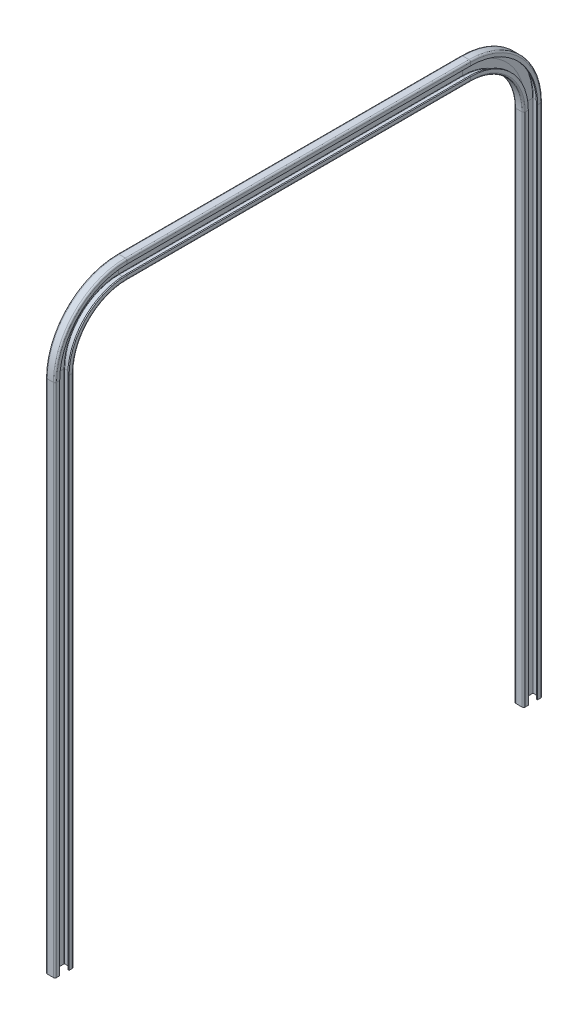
ISO-10303-21;
HEADER;
FILE_DESCRIPTION(('STEP AP214'),'2;1');
FILE_NAME('part.step','',(''),(''),'','','');
FILE_SCHEMA(('AUTOMOTIVE_DESIGN { 1 0 10303 214 1 1 1 1 }'));
ENDSEC;
DATA;
#1=APPLICATION_CONTEXT('core data for automotive mechanical design processes');
#2=APPLICATION_PROTOCOL_DEFINITION('international standard','automotive_design',2000,#1);
#3=PRODUCT_CONTEXT('',#1,'mechanical');
#4=PRODUCT('Part','Part','',(#3));
#5=PRODUCT_RELATED_PRODUCT_CATEGORY('part','',(#4));
#6=PRODUCT_DEFINITION_FORMATION('','',#4);
#7=PRODUCT_DEFINITION_CONTEXT('part definition',#1,'design');
#8=PRODUCT_DEFINITION('design','',#6,#7);
#9=PRODUCT_DEFINITION_SHAPE('','',#8);
#10=(LENGTH_UNIT() NAMED_UNIT(*) SI_UNIT(.MILLI.,.METRE.));
#11=(NAMED_UNIT(*) PLANE_ANGLE_UNIT() SI_UNIT($,.RADIAN.));
#12=(NAMED_UNIT(*) SI_UNIT($,.STERADIAN.) SOLID_ANGLE_UNIT());
#13=UNCERTAINTY_MEASURE_WITH_UNIT(LENGTH_MEASURE(1.E-05),#10,'distance_accuracy_value','');
#14=(GEOMETRIC_REPRESENTATION_CONTEXT(3) GLOBAL_UNCERTAINTY_ASSIGNED_CONTEXT((#13)) GLOBAL_UNIT_ASSIGNED_CONTEXT((#10,
#11,#12)) REPRESENTATION_CONTEXT('',''));
#15=CARTESIAN_POINT('',(0.,0.,0.));
#16=DIRECTION('',(0.,0.,1.));
#17=DIRECTION('',(1.,0.,0.));
#18=AXIS2_PLACEMENT_3D('',#15,#16,#17);
#19=CARTESIAN_POINT('',(5.,0.,-25.));
#20=DIRECTION('',(0.,-1.,0.));
#21=DIRECTION('',(0.,0.,-1.));
#22=AXIS2_PLACEMENT_3D('',#19,#20,#21);
#23=PLANE('',#22);
#24=DIRECTION('',(0.,0.,1.));
#25=VECTOR('',#24,1.);
#26=CARTESIAN_POINT('',(0.,0.,0.));
#27=LINE('',#26,#25);
#28=CARTESIAN_POINT('',(0.,0.,-25.));
#29=VERTEX_POINT('',#28);
#30=CARTESIAN_POINT('',(0.,0.,0.));
#31=VERTEX_POINT('',#30);
#32=EDGE_CURVE('E256',#29,#31,#27,.T.);
#33=ORIENTED_EDGE('',*,*,#32,.F.);
#34=CARTESIAN_POINT('',(5.,0.,-25.));
#35=DIRECTION('',(0.,1.,0.));
#36=DIRECTION('',(0.,0.,-1.));
#37=AXIS2_PLACEMENT_3D('',#34,#35,#36);
#38=CIRCLE('',#37,5.00000000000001);
#39=CARTESIAN_POINT('',(5.,0.,-30.));
#40=VERTEX_POINT('',#39);
#41=EDGE_CURVE('E261',#40,#29,#38,.T.);
#42=ORIENTED_EDGE('',*,*,#41,.F.);
#43=DIRECTION('',(-1.,0.,0.));
#44=VECTOR('',#43,1.);
#45=CARTESIAN_POINT('',(5.,0.,-30.));
#46=LINE('',#45,#44);
#47=CARTESIAN_POINT('',(25.,0.,-30.));
#48=VERTEX_POINT('',#47);
#49=EDGE_CURVE('E1086',#48,#40,#46,.T.);
#50=ORIENTED_EDGE('',*,*,#49,.F.);
#51=CARTESIAN_POINT('',(25.,0.,-25.));
#52=DIRECTION('',(0.,1.,0.));
#53=DIRECTION('',(0.,0.,-1.));
#54=AXIS2_PLACEMENT_3D('',#51,#52,#53);
#55=CIRCLE('',#54,5.);
#56=CARTESIAN_POINT('',(30.,0.,-25.));
#57=VERTEX_POINT('',#56);
#58=EDGE_CURVE('E1058',#57,#48,#55,.T.);
#59=ORIENTED_EDGE('',*,*,#58,.F.);
#60=DIRECTION('',(0.,0.,-1.));
#61=VECTOR('',#60,1.);
#62=CARTESIAN_POINT('',(30.,0.,-25.));
#63=LINE('',#62,#61);
#64=CARTESIAN_POINT('',(30.,0.,-15.));
#65=VERTEX_POINT('',#64);
#66=EDGE_CURVE('E1032',#65,#57,#63,.T.);
#67=ORIENTED_EDGE('',*,*,#66,.F.);
#68=DIRECTION('',(1.,0.,0.));
#69=VECTOR('',#68,1.);
#70=CARTESIAN_POINT('',(30.,0.,-15.));
#71=LINE('',#70,#69);
#72=CARTESIAN_POINT('',(26.,0.,-15.));
#73=VERTEX_POINT('',#72);
#74=EDGE_CURVE('E1004',#73,#65,#71,.T.);
#75=ORIENTED_EDGE('',*,*,#74,.F.);
#76=DIRECTION('',(0.,0.,1.));
#77=VECTOR('',#76,1.);
#78=CARTESIAN_POINT('',(26.,0.,-15.));
#79=LINE('',#78,#77);
#80=CARTESIAN_POINT('',(26.,0.,-25.));
#81=VERTEX_POINT('',#80);
#82=EDGE_CURVE('E462',#81,#73,#79,.T.);
#83=ORIENTED_EDGE('',*,*,#82,.F.);
#84=CARTESIAN_POINT('',(25.,0.,-25.));
#85=DIRECTION('',(0.,-1.,0.));
#86=DIRECTION('',(0.,0.,1.));
#87=AXIS2_PLACEMENT_3D('',#84,#85,#86);
#88=CIRCLE('',#87,0.999999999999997);
#89=CARTESIAN_POINT('',(25.,0.,-26.));
#90=VERTEX_POINT('',#89);
#91=EDGE_CURVE('E466',#90,#81,#88,.T.);
#92=ORIENTED_EDGE('',*,*,#91,.F.);
#93=DIRECTION('',(1.,0.,0.));
#94=VECTOR('',#93,1.);
#95=CARTESIAN_POINT('',(25.,0.,-26.));
#96=LINE('',#95,#94);
#97=CARTESIAN_POINT('',(5.,0.,-26.));
#98=VERTEX_POINT('',#97);
#99=EDGE_CURVE('E471',#98,#90,#96,.T.);
#100=ORIENTED_EDGE('',*,*,#99,.F.);
#101=CARTESIAN_POINT('',(5.,0.,-25.));
#102=DIRECTION('',(0.,-1.,0.));
#103=DIRECTION('',(0.,0.,1.));
#104=AXIS2_PLACEMENT_3D('',#101,#102,#103);
#105=CIRCLE('',#104,1.);
#106=CARTESIAN_POINT('',(4.,0.,-25.));
#107=VERTEX_POINT('',#106);
#108=EDGE_CURVE('E880',#107,#98,#105,.T.);
#109=ORIENTED_EDGE('',*,*,#108,.F.);
#110=DIRECTION('',(0.,0.,-1.));
#111=VECTOR('',#110,1.);
#112=CARTESIAN_POINT('',(4.,0.,-25.));
#113=LINE('',#112,#111);
#114=CARTESIAN_POINT('',(4.,0.,0.));
#115=VERTEX_POINT('',#114);
#116=EDGE_CURVE('E851',#115,#107,#113,.T.);
#117=ORIENTED_EDGE('',*,*,#116,.F.);
#118=DIRECTION('',(0.,0.,-1.));
#119=VECTOR('',#118,1.);
#120=CARTESIAN_POINT('',(4.,0.,25.));
#121=LINE('',#120,#119);
#122=CARTESIAN_POINT('',(4.,0.,25.));
#123=VERTEX_POINT('',#122);
#124=EDGE_CURVE('E824',#123,#115,#121,.T.);
#125=ORIENTED_EDGE('',*,*,#124,.F.);
#126=CARTESIAN_POINT('',(5.,0.,25.));
#127=DIRECTION('',(0.,-1.,0.));
#128=DIRECTION('',(0.,0.,-1.));
#129=AXIS2_PLACEMENT_3D('',#126,#127,#128);
#130=CIRCLE('',#129,1.);
#131=CARTESIAN_POINT('',(5.,0.,26.));
#132=VERTEX_POINT('',#131);
#133=EDGE_CURVE('E795',#132,#123,#130,.T.);
#134=ORIENTED_EDGE('',*,*,#133,.F.);
#135=DIRECTION('',(-1.,0.,0.));
#136=VECTOR('',#135,1.);
#137=CARTESIAN_POINT('',(25.,0.,26.));
#138=LINE('',#137,#136);
#139=CARTESIAN_POINT('',(25.,0.,26.));
#140=VERTEX_POINT('',#139);
#141=EDGE_CURVE('E670',#140,#132,#138,.T.);
#142=ORIENTED_EDGE('',*,*,#141,.F.);
#143=CARTESIAN_POINT('',(25.,0.,25.));
#144=DIRECTION('',(0.,-1.,0.));
#145=DIRECTION('',(0.,0.,-1.));
#146=AXIS2_PLACEMENT_3D('',#143,#144,#145);
#147=CIRCLE('',#146,1.);
#148=CARTESIAN_POINT('',(26.,0.,25.));
#149=VERTEX_POINT('',#148);
#150=EDGE_CURVE('E674',#149,#140,#147,.T.);
#151=ORIENTED_EDGE('',*,*,#150,.F.);
#152=DIRECTION('',(0.,0.,1.));
#153=VECTOR('',#152,1.);
#154=CARTESIAN_POINT('',(26.,0.,15.));
#155=LINE('',#154,#153);
#156=CARTESIAN_POINT('',(26.,0.,15.));
#157=VERTEX_POINT('',#156);
#158=EDGE_CURVE('E679',#157,#149,#155,.T.);
#159=ORIENTED_EDGE('',*,*,#158,.F.);
#160=DIRECTION('',(-1.,0.,0.));
#161=VECTOR('',#160,1.);
#162=CARTESIAN_POINT('',(30.,0.,15.));
#163=LINE('',#162,#161);
#164=CARTESIAN_POINT('',(30.,0.,15.));
#165=VERTEX_POINT('',#164);
#166=EDGE_CURVE('E731',#165,#157,#163,.T.);
#167=ORIENTED_EDGE('',*,*,#166,.F.);
#168=DIRECTION('',(0.,0.,-1.));
#169=VECTOR('',#168,1.);
#170=CARTESIAN_POINT('',(30.,0.,25.));
#171=LINE('',#170,#169);
#172=CARTESIAN_POINT('',(30.,0.,25.));
#173=VERTEX_POINT('',#172);
#174=EDGE_CURVE('E1294',#173,#165,#171,.T.);
#175=ORIENTED_EDGE('',*,*,#174,.F.);
#176=CARTESIAN_POINT('',(25.,0.,25.));
#177=DIRECTION('',(0.,1.,0.));
#178=DIRECTION('',(0.,0.,1.));
#179=AXIS2_PLACEMENT_3D('',#176,#177,#178);
#180=CIRCLE('',#179,5.);
#181=CARTESIAN_POINT('',(25.,0.,30.));
#182=VERTEX_POINT('',#181);
#183=EDGE_CURVE('E1266',#182,#173,#180,.T.);
#184=ORIENTED_EDGE('',*,*,#183,.F.);
#185=DIRECTION('',(1.,0.,0.));
#186=VECTOR('',#185,1.);
#187=CARTESIAN_POINT('',(5.00000000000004,0.,30.));
#188=LINE('',#187,#186);
#189=CARTESIAN_POINT('',(5.,0.,30.));
#190=VERTEX_POINT('',#189);
#191=EDGE_CURVE('E1239',#190,#182,#188,.T.);
#192=ORIENTED_EDGE('',*,*,#191,.F.);
#193=CARTESIAN_POINT('',(5.,0.,25.));
#194=DIRECTION('',(0.,1.,0.));
#195=DIRECTION('',(0.,0.,1.));
#196=AXIS2_PLACEMENT_3D('',#193,#194,#195);
#197=CIRCLE('',#196,5.);
#198=CARTESIAN_POINT('',(0.,0.,25.));
#199=VERTEX_POINT('',#198);
#200=EDGE_CURVE('E1210',#199,#190,#197,.T.);
#201=ORIENTED_EDGE('',*,*,#200,.F.);
#202=DIRECTION('',(0.,0.,1.));
#203=VECTOR('',#202,1.);
#204=CARTESIAN_POINT('',(0.,0.,0.));
#205=LINE('',#204,#203);
#206=EDGE_CURVE('E252',#31,#199,#205,.T.);
#207=ORIENTED_EDGE('',*,*,#206,.F.);
#208=EDGE_LOOP('',(#33,#42,#50,#59,#67,#75,#83,#92,#100,#109,#117,#125,#134,#142,#151,#159,#167,
#175,#184,#192,#201,#207));
#209=FACE_BOUND('',#208,.T.);
#210=ADVANCED_FACE('F38',(#209),#23,.T.);
#211=CARTESIAN_POINT('',(5.,4.40724897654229E-13,-1475.));
#212=DIRECTION('',(0.,1.,0.));
#213=DIRECTION('',(0.,0.,1.));
#214=AXIS2_PLACEMENT_3D('',#211,#212,#213);
#215=PLANE('',#214);
#216=DIRECTION('',(0.,0.,-1.));
#217=VECTOR('',#216,1.);
#218=CARTESIAN_POINT('',(0.,4.44089209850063E-13,-1500.));
#219=LINE('',#218,#217);
#220=CARTESIAN_POINT('',(0.,6.64451658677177E-13,-1475.));
#221=VERTEX_POINT('',#220);
#222=CARTESIAN_POINT('',(0.,6.66133814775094E-13,-1500.));
#223=VERTEX_POINT('',#222);
#224=EDGE_CURVE('E1179',#221,#223,#219,.T.);
#225=ORIENTED_EDGE('',*,*,#224,.T.);
#226=DIRECTION('',(0.,0.,-1.));
#227=VECTOR('',#226,1.);
#228=CARTESIAN_POINT('',(0.,4.44089209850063E-13,-1500.));
#229=LINE('',#228,#227);
#230=CARTESIAN_POINT('',(0.,6.67815970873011E-13,-1525.));
#231=VERTEX_POINT('',#230);
#232=EDGE_CURVE('E1208',#223,#231,#229,.T.);
#233=ORIENTED_EDGE('',*,*,#232,.T.);
#234=CARTESIAN_POINT('',(5.,4.47453522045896E-13,-1525.));
#235=DIRECTION('',(0.,-1.,0.));
#236=DIRECTION('',(0.,0.,-1.));
#237=AXIS2_PLACEMENT_3D('',#234,#235,#236);
#238=CIRCLE('',#237,5.);
#239=CARTESIAN_POINT('',(5.,6.68152402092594E-13,-1530.));
#240=VERTEX_POINT('',#239);
#241=EDGE_CURVE('E1236',#231,#240,#238,.T.);
#242=ORIENTED_EDGE('',*,*,#241,.T.);
#243=DIRECTION('',(1.,0.,0.));
#244=VECTOR('',#243,1.);
#245=CARTESIAN_POINT('',(5.00000000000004,4.48126384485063E-13,-1530.));
#246=LINE('',#245,#244);
#247=CARTESIAN_POINT('',(25.,6.68152402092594E-13,-1530.));
#248=VERTEX_POINT('',#247);
#249=EDGE_CURVE('E64',#240,#248,#246,.T.);
#250=ORIENTED_EDGE('',*,*,#249,.T.);
#251=CARTESIAN_POINT('',(25.,4.47453522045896E-13,-1525.));
#252=DIRECTION('',(0.,-1.,0.));
#253=DIRECTION('',(0.,0.,-1.));
#254=AXIS2_PLACEMENT_3D('',#251,#252,#253);
#255=CIRCLE('',#254,5.);
#256=CARTESIAN_POINT('',(30.,6.67815970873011E-13,-1525.));
#257=VERTEX_POINT('',#256);
#258=EDGE_CURVE('E55',#248,#257,#255,.T.);
#259=ORIENTED_EDGE('',*,*,#258,.T.);
#260=DIRECTION('',(0.,0.,1.));
#261=VECTOR('',#260,1.);
#262=CARTESIAN_POINT('',(30.,4.47453522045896E-13,-1525.));
#263=LINE('',#262,#261);
#264=CARTESIAN_POINT('',(30.,6.67143108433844E-13,-1515.));
#265=VERTEX_POINT('',#264);
#266=EDGE_CURVE('E11',#257,#265,#263,.T.);
#267=ORIENTED_EDGE('',*,*,#266,.T.);
#268=DIRECTION('',(-1.,0.,0.));
#269=VECTOR('',#268,1.);
#270=CARTESIAN_POINT('',(30.,4.46107797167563E-13,-1515.));
#271=LINE('',#270,#269);
#272=CARTESIAN_POINT('',(26.,6.67143108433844E-13,-1515.));
#273=VERTEX_POINT('',#272);
#274=EDGE_CURVE('E698',#265,#273,#271,.T.);
#275=ORIENTED_EDGE('',*,*,#274,.T.);
#276=DIRECTION('',(0.,0.,-1.));
#277=VECTOR('',#276,1.);
#278=CARTESIAN_POINT('',(26.,4.46107797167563E-13,-1515.));
#279=LINE('',#278,#277);
#280=CARTESIAN_POINT('',(26.,6.67815970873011E-13,-1525.));
#281=VERTEX_POINT('',#280);
#282=EDGE_CURVE('E701',#273,#281,#279,.T.);
#283=ORIENTED_EDGE('',*,*,#282,.T.);
#284=CARTESIAN_POINT('',(25.,4.47453522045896E-13,-1525.));
#285=DIRECTION('',(0.,1.,0.));
#286=DIRECTION('',(0.,0.,1.));
#287=AXIS2_PLACEMENT_3D('',#284,#285,#286);
#288=CIRCLE('',#287,1.);
#289=CARTESIAN_POINT('',(25.,6.67883257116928E-13,-1526.));
#290=VERTEX_POINT('',#289);
#291=EDGE_CURVE('E765',#281,#290,#288,.T.);
#292=ORIENTED_EDGE('',*,*,#291,.T.);
#293=DIRECTION('',(-1.,0.,0.));
#294=VECTOR('',#293,1.);
#295=CARTESIAN_POINT('',(25.,4.4758809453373E-13,-1526.));
#296=LINE('',#295,#294);
#297=CARTESIAN_POINT('',(5.,6.67883257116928E-13,-1526.));
#298=VERTEX_POINT('',#297);
#299=EDGE_CURVE('E793',#290,#298,#296,.T.);
#300=ORIENTED_EDGE('',*,*,#299,.T.);
#301=CARTESIAN_POINT('',(5.,4.47453522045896E-13,-1525.));
#302=DIRECTION('',(0.,1.,0.));
#303=DIRECTION('',(0.,0.,1.));
#304=AXIS2_PLACEMENT_3D('',#301,#302,#303);
#305=CIRCLE('',#304,1.);
#306=CARTESIAN_POINT('',(4.,6.67815970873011E-13,-1525.));
#307=VERTEX_POINT('',#306);
#308=EDGE_CURVE('E821',#298,#307,#305,.T.);
#309=ORIENTED_EDGE('',*,*,#308,.T.);
#310=DIRECTION('',(0.,0.,1.));
#311=VECTOR('',#310,1.);
#312=CARTESIAN_POINT('',(4.,4.47453522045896E-13,-1525.));
#313=LINE('',#312,#311);
#314=CARTESIAN_POINT('',(4.,6.66133814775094E-13,-1500.));
#315=VERTEX_POINT('',#314);
#316=EDGE_CURVE('E501',#307,#315,#313,.T.);
#317=ORIENTED_EDGE('',*,*,#316,.T.);
#318=DIRECTION('',(0.,0.,1.));
#319=VECTOR('',#318,1.);
#320=CARTESIAN_POINT('',(4.,4.40724897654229E-13,-1475.));
#321=LINE('',#320,#319);
#322=CARTESIAN_POINT('',(4.,6.64451658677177E-13,-1475.));
#323=VERTEX_POINT('',#322);
#324=EDGE_CURVE('E496',#315,#323,#321,.T.);
#325=ORIENTED_EDGE('',*,*,#324,.T.);
#326=CARTESIAN_POINT('',(5.,4.40724897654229E-13,-1475.));
#327=DIRECTION('',(0.,1.,0.));
#328=DIRECTION('',(0.,0.,-1.));
#329=AXIS2_PLACEMENT_3D('',#326,#327,#328);
#330=CIRCLE('',#329,1.);
#331=CARTESIAN_POINT('',(5.,6.6438437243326E-13,-1474.));
#332=VERTEX_POINT('',#331);
#333=EDGE_CURVE('E491',#323,#332,#330,.T.);
#334=ORIENTED_EDGE('',*,*,#333,.T.);
#335=DIRECTION('',(1.,0.,0.));
#336=VECTOR('',#335,1.);
#337=CARTESIAN_POINT('',(25.,4.40590325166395E-13,-1474.));
#338=LINE('',#337,#336);
#339=CARTESIAN_POINT('',(25.,6.6438437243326E-13,-1474.));
#340=VERTEX_POINT('',#339);
#341=EDGE_CURVE('E941',#332,#340,#338,.T.);
#342=ORIENTED_EDGE('',*,*,#341,.T.);
#343=CARTESIAN_POINT('',(25.,4.40724897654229E-13,-1475.));
#344=DIRECTION('',(0.,1.,0.));
#345=DIRECTION('',(0.,0.,-1.));
#346=AXIS2_PLACEMENT_3D('',#343,#344,#345);
#347=CIRCLE('',#346,0.999999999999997);
#348=CARTESIAN_POINT('',(26.,6.64451658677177E-13,-1475.));
#349=VERTEX_POINT('',#348);
#350=EDGE_CURVE('E973',#340,#349,#347,.T.);
#351=ORIENTED_EDGE('',*,*,#350,.T.);
#352=DIRECTION('',(0.,0.,-1.));
#353=VECTOR('',#352,1.);
#354=CARTESIAN_POINT('',(26.,4.42070622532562E-13,-1485.));
#355=LINE('',#354,#353);
#356=CARTESIAN_POINT('',(26.,6.65124521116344E-13,-1485.));
#357=VERTEX_POINT('',#356);
#358=EDGE_CURVE('E1002',#349,#357,#355,.T.);
#359=ORIENTED_EDGE('',*,*,#358,.T.);
#360=DIRECTION('',(1.,0.,0.));
#361=VECTOR('',#360,1.);
#362=CARTESIAN_POINT('',(30.,4.42070622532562E-13,-1485.));
#363=LINE('',#362,#361);
#364=CARTESIAN_POINT('',(30.,6.65124521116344E-13,-1485.));
#365=VERTEX_POINT('',#364);
#366=EDGE_CURVE('E1029',#357,#365,#363,.T.);
#367=ORIENTED_EDGE('',*,*,#366,.T.);
#368=DIRECTION('',(0.,0.,1.));
#369=VECTOR('',#368,1.);
#370=CARTESIAN_POINT('',(30.,4.40724897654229E-13,-1475.));
#371=LINE('',#370,#369);
#372=CARTESIAN_POINT('',(30.,6.64451658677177E-13,-1475.));
#373=VERTEX_POINT('',#372);
#374=EDGE_CURVE('E291',#365,#373,#371,.T.);
#375=ORIENTED_EDGE('',*,*,#374,.T.);
#376=CARTESIAN_POINT('',(25.,4.40724897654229E-13,-1475.));
#377=DIRECTION('',(0.,-1.,0.));
#378=DIRECTION('',(0.,0.,1.));
#379=AXIS2_PLACEMENT_3D('',#376,#377,#378);
#380=CIRCLE('',#379,5.);
#381=CARTESIAN_POINT('',(25.,6.64115227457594E-13,-1470.));
#382=VERTEX_POINT('',#381);
#383=EDGE_CURVE('E286',#373,#382,#380,.T.);
#384=ORIENTED_EDGE('',*,*,#383,.T.);
#385=DIRECTION('',(-1.,0.,0.));
#386=VECTOR('',#385,1.);
#387=CARTESIAN_POINT('',(5.,4.40052035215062E-13,-1470.));
#388=LINE('',#387,#386);
#389=CARTESIAN_POINT('',(5.,6.64115227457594E-13,-1470.));
#390=VERTEX_POINT('',#389);
#391=EDGE_CURVE('E281',#382,#390,#388,.T.);
#392=ORIENTED_EDGE('',*,*,#391,.T.);
#393=CARTESIAN_POINT('',(5.,4.40724897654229E-13,-1475.));
#394=DIRECTION('',(0.,-1.,0.));
#395=DIRECTION('',(0.,0.,1.));
#396=AXIS2_PLACEMENT_3D('',#393,#394,#395);
#397=CIRCLE('',#396,5.00000000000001);
#398=EDGE_CURVE('E1147',#390,#221,#397,.T.);
#399=ORIENTED_EDGE('',*,*,#398,.T.);
#400=EDGE_LOOP('',(#225,#233,#242,#250,#259,#267,#275,#283,#292,#300,#309,#317,#325,#334,#342,
#351,#359,#367,#375,#384,#392,#399));
#401=FACE_BOUND('',#400,.T.);
#402=ADVANCED_FACE('F700',(#401),#215,.F.);
#403=CARTESIAN_POINT('',(30.,0.,15.));
#404=DIRECTION('',(0.,0.,-1.));
#405=DIRECTION('',(-1.,0.,0.));
#406=AXIS2_PLACEMENT_3D('',#403,#404,#405);
#407=PLANE('',#406);
#408=DIRECTION('',(0.,1.,0.));
#409=VECTOR('',#408,1.);
#410=CARTESIAN_POINT('',(26.,0.,15.));
#411=LINE('',#410,#409);
#412=CARTESIAN_POINT('',(26.,1650.,15.));
#413=VERTEX_POINT('',#412);
#414=EDGE_CURVE('E736',#157,#413,#411,.T.);
#415=ORIENTED_EDGE('',*,*,#414,.T.);
#416=DIRECTION('',(-1.,0.,0.));
#417=VECTOR('',#416,1.);
#418=CARTESIAN_POINT('',(30.,1650.,15.));
#419=LINE('',#418,#417);
#420=CARTESIAN_POINT('',(30.,1650.,15.));
#421=VERTEX_POINT('',#420);
#422=EDGE_CURVE('E1365',#421,#413,#419,.T.);
#423=ORIENTED_EDGE('',*,*,#422,.F.);
#424=DIRECTION('',(0.,1.,0.));
#425=VECTOR('',#424,1.);
#426=CARTESIAN_POINT('',(30.,0.,15.));
#427=LINE('',#426,#425);
#428=EDGE_CURVE('E1322',#165,#421,#427,.T.);
#429=ORIENTED_EDGE('',*,*,#428,.F.);
#430=ORIENTED_EDGE('',*,*,#166,.T.);
#431=EDGE_LOOP('',(#415,#423,#429,#430));
#432=FACE_BOUND('',#431,.T.);
#433=ADVANCED_FACE('F1373',(#432),#407,.T.);
#434=CARTESIAN_POINT('',(26.,0.,15.));
#435=DIRECTION('',(-1.,0.,0.));
#436=DIRECTION('',(0.,0.,1.));
#437=AXIS2_PLACEMENT_3D('',#434,#435,#436);
#438=PLANE('',#437);
#439=DIRECTION('',(0.,1.,0.));
#440=VECTOR('',#439,1.);
#441=CARTESIAN_POINT('',(26.,0.,25.));
#442=LINE('',#441,#440);
#443=CARTESIAN_POINT('',(26.,1650.,25.));
#444=VERTEX_POINT('',#443);
#445=EDGE_CURVE('E735',#149,#444,#442,.T.);
#446=ORIENTED_EDGE('',*,*,#445,.T.);
#447=DIRECTION('',(0.,0.,1.));
#448=VECTOR('',#447,1.);
#449=CARTESIAN_POINT('',(26.,1650.,15.));
#450=LINE('',#449,#448);
#451=EDGE_CURVE('E732',#413,#444,#450,.T.);
#452=ORIENTED_EDGE('',*,*,#451,.F.);
#453=ORIENTED_EDGE('',*,*,#414,.F.);
#454=ORIENTED_EDGE('',*,*,#158,.T.);
#455=EDGE_LOOP('',(#446,#452,#453,#454));
#456=FACE_BOUND('',#455,.T.);
#457=ADVANCED_FACE('F1377',(#456),#438,.T.);
#458=CARTESIAN_POINT('',(25.,0.,25.));
#459=DIRECTION('',(0.,1.,0.));
#460=DIRECTION('',(0.,0.,1.));
#461=AXIS2_PLACEMENT_3D('',#458,#459,#460);
#462=CYLINDRICAL_SURFACE('',#461,1.);
#463=DIRECTION('',(0.,1.,0.));
#464=VECTOR('',#463,1.);
#465=CARTESIAN_POINT('',(25.,0.,26.));
#466=LINE('',#465,#464);
#467=CARTESIAN_POINT('',(25.,1650.,26.));
#468=VERTEX_POINT('',#467);
#469=EDGE_CURVE('E768',#140,#468,#466,.T.);
#470=ORIENTED_EDGE('',*,*,#469,.T.);
#471=CARTESIAN_POINT('',(25.,1650.,25.));
#472=DIRECTION('',(0.,-1.,0.));
#473=DIRECTION('',(0.,0.,-1.));
#474=AXIS2_PLACEMENT_3D('',#471,#472,#473);
#475=CIRCLE('',#474,1.);
#476=EDGE_CURVE('E739',#444,#468,#475,.T.);
#477=ORIENTED_EDGE('',*,*,#476,.F.);
#478=ORIENTED_EDGE('',*,*,#445,.F.);
#479=ORIENTED_EDGE('',*,*,#150,.T.);
#480=EDGE_LOOP('',(#470,#477,#478,#479));
#481=FACE_BOUND('',#480,.T.);
#482=ADVANCED_FACE('F1489',(#481),#462,.F.);
#483=CARTESIAN_POINT('',(25.,0.,26.));
#484=DIRECTION('',(0.,0.,-1.));
#485=DIRECTION('',(-1.,0.,0.));
#486=AXIS2_PLACEMENT_3D('',#483,#484,#485);
#487=PLANE('',#486);
#488=DIRECTION('',(0.,1.,0.));
#489=VECTOR('',#488,1.);
#490=CARTESIAN_POINT('',(5.,0.,26.));
#491=LINE('',#490,#489);
#492=CARTESIAN_POINT('',(5.,1650.,26.));
#493=VERTEX_POINT('',#492);
#494=EDGE_CURVE('E797',#132,#493,#491,.T.);
#495=ORIENTED_EDGE('',*,*,#494,.T.);
#496=DIRECTION('',(-1.,0.,0.));
#497=VECTOR('',#496,1.);
#498=CARTESIAN_POINT('',(25.,1650.,26.));
#499=LINE('',#498,#497);
#500=EDGE_CURVE('E771',#468,#493,#499,.T.);
#501=ORIENTED_EDGE('',*,*,#500,.F.);
#502=ORIENTED_EDGE('',*,*,#469,.F.);
#503=ORIENTED_EDGE('',*,*,#141,.T.);
#504=EDGE_LOOP('',(#495,#501,#502,#503));
#505=FACE_BOUND('',#504,.T.);
#506=ADVANCED_FACE('F1492',(#505),#487,.T.);
#507=CARTESIAN_POINT('',(5.,0.,25.));
#508=DIRECTION('',(0.,1.,0.));
#509=DIRECTION('',(0.,0.,1.));
#510=AXIS2_PLACEMENT_3D('',#507,#508,#509);
#511=CYLINDRICAL_SURFACE('',#510,1.);
#512=DIRECTION('',(0.,1.,0.));
#513=VECTOR('',#512,1.);
#514=CARTESIAN_POINT('',(4.,0.,25.));
#515=LINE('',#514,#513);
#516=CARTESIAN_POINT('',(4.,1650.,25.));
#517=VERTEX_POINT('',#516);
#518=EDGE_CURVE('E826',#123,#517,#515,.T.);
#519=ORIENTED_EDGE('',*,*,#518,.T.);
#520=CARTESIAN_POINT('',(5.,1650.,25.));
#521=DIRECTION('',(0.,-1.,0.));
#522=DIRECTION('',(0.,0.,-1.));
#523=AXIS2_PLACEMENT_3D('',#520,#521,#522);
#524=CIRCLE('',#523,1.);
#525=EDGE_CURVE('E800',#493,#517,#524,.T.);
#526=ORIENTED_EDGE('',*,*,#525,.F.);
#527=ORIENTED_EDGE('',*,*,#494,.F.);
#528=ORIENTED_EDGE('',*,*,#133,.T.);
#529=EDGE_LOOP('',(#519,#526,#527,#528));
#530=FACE_BOUND('',#529,.T.);
#531=ADVANCED_FACE('F1560',(#530),#511,.F.);
#532=CARTESIAN_POINT('',(4.,0.,25.));
#533=DIRECTION('',(1.,0.,0.));
#534=DIRECTION('',(0.,0.,-1.));
#535=AXIS2_PLACEMENT_3D('',#532,#533,#534);
#536=PLANE('',#535);
#537=DIRECTION('',(0.,1.,0.));
#538=VECTOR('',#537,1.);
#539=CARTESIAN_POINT('',(4.,0.,0.));
#540=LINE('',#539,#538);
#541=CARTESIAN_POINT('',(4.,1650.,0.));
#542=VERTEX_POINT('',#541);
#543=EDGE_CURVE('E854',#115,#542,#540,.T.);
#544=ORIENTED_EDGE('',*,*,#543,.T.);
#545=DIRECTION('',(0.,0.,-1.));
#546=VECTOR('',#545,1.);
#547=CARTESIAN_POINT('',(4.,1650.,25.));
#548=LINE('',#547,#546);
#549=EDGE_CURVE('E829',#517,#542,#548,.T.);
#550=ORIENTED_EDGE('',*,*,#549,.F.);
#551=ORIENTED_EDGE('',*,*,#518,.F.);
#552=ORIENTED_EDGE('',*,*,#124,.T.);
#553=EDGE_LOOP('',(#544,#550,#551,#552));
#554=FACE_BOUND('',#553,.T.);
#555=ADVANCED_FACE('F1569',(#554),#536,.T.);
#556=CARTESIAN_POINT('',(4.,0.,-25.));
#557=DIRECTION('',(1.,0.,0.));
#558=DIRECTION('',(0.,0.,-1.));
#559=AXIS2_PLACEMENT_3D('',#556,#557,#558);
#560=PLANE('',#559);
#561=DIRECTION('',(0.,1.,0.));
#562=VECTOR('',#561,1.);
#563=CARTESIAN_POINT('',(4.,0.,-25.));
#564=LINE('',#563,#562);
#565=CARTESIAN_POINT('',(4.,1650.,-25.));
#566=VERTEX_POINT('',#565);
#567=EDGE_CURVE('E883',#107,#566,#564,.T.);
#568=ORIENTED_EDGE('',*,*,#567,.T.);
#569=DIRECTION('',(0.,0.,-1.));
#570=VECTOR('',#569,1.);
#571=CARTESIAN_POINT('',(4.,1650.,-25.));
#572=LINE('',#571,#570);
#573=EDGE_CURVE('E857',#542,#566,#572,.T.);
#574=ORIENTED_EDGE('',*,*,#573,.F.);
#575=ORIENTED_EDGE('',*,*,#543,.F.);
#576=ORIENTED_EDGE('',*,*,#116,.T.);
#577=EDGE_LOOP('',(#568,#574,#575,#576));
#578=FACE_BOUND('',#577,.T.);
#579=ADVANCED_FACE('F1579',(#578),#560,.T.);
#580=CARTESIAN_POINT('',(5.,0.,-25.));
#581=DIRECTION('',(0.,1.,0.));
#582=DIRECTION('',(0.,0.,1.));
#583=AXIS2_PLACEMENT_3D('',#580,#581,#582);
#584=CYLINDRICAL_SURFACE('',#583,1.);
#585=DIRECTION('',(0.,1.,0.));
#586=VECTOR('',#585,1.);
#587=CARTESIAN_POINT('',(5.,0.,-26.));
#588=LINE('',#587,#586);
#589=CARTESIAN_POINT('',(5.,1650.,-26.));
#590=VERTEX_POINT('',#589);
#591=EDGE_CURVE('E912',#98,#590,#588,.T.);
#592=ORIENTED_EDGE('',*,*,#591,.T.);
#593=CARTESIAN_POINT('',(5.,1650.,-25.));
#594=DIRECTION('',(0.,-1.,0.));
#595=DIRECTION('',(0.,0.,1.));
#596=AXIS2_PLACEMENT_3D('',#593,#594,#595);
#597=CIRCLE('',#596,1.);
#598=EDGE_CURVE('E886',#566,#590,#597,.T.);
#599=ORIENTED_EDGE('',*,*,#598,.F.);
#600=ORIENTED_EDGE('',*,*,#567,.F.);
#601=ORIENTED_EDGE('',*,*,#108,.T.);
#602=EDGE_LOOP('',(#592,#599,#600,#601));
#603=FACE_BOUND('',#602,.T.);
#604=ADVANCED_FACE('F1589',(#603),#584,.F.);
#605=CARTESIAN_POINT('',(25.,0.,-26.));
#606=DIRECTION('',(0.,0.,1.));
#607=DIRECTION('',(1.,0.,0.));
#608=AXIS2_PLACEMENT_3D('',#605,#606,#607);
#609=PLANE('',#608);
#610=DIRECTION('',(0.,1.,0.));
#611=VECTOR('',#610,1.);
#612=CARTESIAN_POINT('',(25.,0.,-26.));
#613=LINE('',#612,#611);
#614=CARTESIAN_POINT('',(25.,1650.,-26.));
#615=VERTEX_POINT('',#614);
#616=EDGE_CURVE('E945',#90,#615,#613,.T.);
#617=ORIENTED_EDGE('',*,*,#616,.T.);
#618=DIRECTION('',(1.,0.,0.));
#619=VECTOR('',#618,1.);
#620=CARTESIAN_POINT('',(25.,1650.,-26.));
#621=LINE('',#620,#619);
#622=EDGE_CURVE('E915',#590,#615,#621,.T.);
#623=ORIENTED_EDGE('',*,*,#622,.F.);
#624=ORIENTED_EDGE('',*,*,#591,.F.);
#625=ORIENTED_EDGE('',*,*,#99,.T.);
#626=EDGE_LOOP('',(#617,#623,#624,#625));
#627=FACE_BOUND('',#626,.T.);
#628=ADVANCED_FACE('F1599',(#627),#609,.T.);
#629=CARTESIAN_POINT('',(25.,0.,-25.));
#630=DIRECTION('',(0.,1.,0.));
#631=DIRECTION('',(0.,0.,1.));
#632=AXIS2_PLACEMENT_3D('',#629,#630,#631);
#633=CYLINDRICAL_SURFACE('',#632,0.999999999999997);
#634=DIRECTION('',(0.,1.,0.));
#635=VECTOR('',#634,1.);
#636=CARTESIAN_POINT('',(26.,0.,-25.));
#637=LINE('',#636,#635);
#638=CARTESIAN_POINT('',(26.,1650.,-25.));
#639=VERTEX_POINT('',#638);
#640=EDGE_CURVE('E976',#81,#639,#637,.T.);
#641=ORIENTED_EDGE('',*,*,#640,.T.);
#642=CARTESIAN_POINT('',(25.,1650.,-25.));
#643=DIRECTION('',(0.,-1.,0.));
#644=DIRECTION('',(0.,0.,1.));
#645=AXIS2_PLACEMENT_3D('',#642,#643,#644);
#646=CIRCLE('',#645,0.999999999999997);
#647=EDGE_CURVE('E948',#615,#639,#646,.T.);
#648=ORIENTED_EDGE('',*,*,#647,.F.);
#649=ORIENTED_EDGE('',*,*,#616,.F.);
#650=ORIENTED_EDGE('',*,*,#91,.T.);
#651=EDGE_LOOP('',(#641,#648,#649,#650));
#652=FACE_BOUND('',#651,.T.);
#653=ADVANCED_FACE('F1609',(#652),#633,.F.);
#654=CARTESIAN_POINT('',(26.,0.,-15.));
#655=DIRECTION('',(-1.,0.,0.));
#656=DIRECTION('',(0.,0.,1.));
#657=AXIS2_PLACEMENT_3D('',#654,#655,#656);
#658=PLANE('',#657);
#659=DIRECTION('',(0.,1.,0.));
#660=VECTOR('',#659,1.);
#661=CARTESIAN_POINT('',(26.,0.,-15.));
#662=LINE('',#661,#660);
#663=CARTESIAN_POINT('',(26.,1650.,-15.));
#664=VERTEX_POINT('',#663);
#665=EDGE_CURVE('E1006',#73,#664,#662,.T.);
#666=ORIENTED_EDGE('',*,*,#665,.T.);
#667=DIRECTION('',(0.,0.,1.));
#668=VECTOR('',#667,1.);
#669=CARTESIAN_POINT('',(26.,1650.,-15.));
#670=LINE('',#669,#668);
#671=EDGE_CURVE('E979',#639,#664,#670,.T.);
#672=ORIENTED_EDGE('',*,*,#671,.F.);
#673=ORIENTED_EDGE('',*,*,#640,.F.);
#674=ORIENTED_EDGE('',*,*,#82,.T.);
#675=EDGE_LOOP('',(#666,#672,#673,#674));
#676=FACE_BOUND('',#675,.T.);
#677=ADVANCED_FACE('F1619',(#676),#658,.T.);
#678=CARTESIAN_POINT('',(30.,0.,-15.));
#679=DIRECTION('',(0.,0.,1.));
#680=DIRECTION('',(1.,0.,0.));
#681=AXIS2_PLACEMENT_3D('',#678,#679,#680);
#682=PLANE('',#681);
#683=DIRECTION('',(0.,1.,0.));
#684=VECTOR('',#683,1.);
#685=CARTESIAN_POINT('',(30.,0.,-15.));
#686=LINE('',#685,#684);
#687=CARTESIAN_POINT('',(30.,1650.,-15.));
#688=VERTEX_POINT('',#687);
#689=EDGE_CURVE('E1034',#65,#688,#686,.T.);
#690=ORIENTED_EDGE('',*,*,#689,.T.);
#691=DIRECTION('',(1.,0.,0.));
#692=VECTOR('',#691,1.);
#693=CARTESIAN_POINT('',(30.,1650.,-15.));
#694=LINE('',#693,#692);
#695=EDGE_CURVE('E1009',#664,#688,#694,.T.);
#696=ORIENTED_EDGE('',*,*,#695,.F.);
#697=ORIENTED_EDGE('',*,*,#665,.F.);
#698=ORIENTED_EDGE('',*,*,#74,.T.);
#699=EDGE_LOOP('',(#690,#696,#697,#698));
#700=FACE_BOUND('',#699,.T.);
#701=ADVANCED_FACE('F1629',(#700),#682,.T.);
#702=CARTESIAN_POINT('',(30.,0.,-25.));
#703=DIRECTION('',(1.,0.,0.));
#704=DIRECTION('',(0.,0.,-1.));
#705=AXIS2_PLACEMENT_3D('',#702,#703,#704);
#706=PLANE('',#705);
#707=DIRECTION('',(0.,1.,0.));
#708=VECTOR('',#707,1.);
#709=CARTESIAN_POINT('',(30.,0.,-25.));
#710=LINE('',#709,#708);
#711=CARTESIAN_POINT('',(30.,1650.,-25.));
#712=VERTEX_POINT('',#711);
#713=EDGE_CURVE('E1061',#57,#712,#710,.T.);
#714=ORIENTED_EDGE('',*,*,#713,.T.);
#715=DIRECTION('',(0.,0.,-1.));
#716=VECTOR('',#715,1.);
#717=CARTESIAN_POINT('',(30.,1650.,-25.));
#718=LINE('',#717,#716);
#719=EDGE_CURVE('E1037',#688,#712,#718,.T.);
#720=ORIENTED_EDGE('',*,*,#719,.F.);
#721=ORIENTED_EDGE('',*,*,#689,.F.);
#722=ORIENTED_EDGE('',*,*,#66,.T.);
#723=EDGE_LOOP('',(#714,#720,#721,#722));
#724=FACE_BOUND('',#723,.T.);
#725=ADVANCED_FACE('F1639',(#724),#706,.T.);
#726=CARTESIAN_POINT('',(25.,0.,-25.));
#727=DIRECTION('',(0.,1.,0.));
#728=DIRECTION('',(0.,0.,1.));
#729=AXIS2_PLACEMENT_3D('',#726,#727,#728);
#730=CYLINDRICAL_SURFACE('',#729,5.);
#731=DIRECTION('',(0.,1.,0.));
#732=VECTOR('',#731,1.);
#733=CARTESIAN_POINT('',(25.,0.,-30.));
#734=LINE('',#733,#732);
#735=CARTESIAN_POINT('',(25.,1650.,-30.));
#736=VERTEX_POINT('',#735);
#737=EDGE_CURVE('E1089',#48,#736,#734,.T.);
#738=ORIENTED_EDGE('',*,*,#737,.T.);
#739=CARTESIAN_POINT('',(25.,1650.,-25.));
#740=DIRECTION('',(0.,1.,0.));
#741=DIRECTION('',(0.,0.,-1.));
#742=AXIS2_PLACEMENT_3D('',#739,#740,#741);
#743=CIRCLE('',#742,5.);
#744=EDGE_CURVE('E1064',#712,#736,#743,.T.);
#745=ORIENTED_EDGE('',*,*,#744,.F.);
#746=ORIENTED_EDGE('',*,*,#713,.F.);
#747=ORIENTED_EDGE('',*,*,#58,.T.);
#748=EDGE_LOOP('',(#738,#745,#746,#747));
#749=FACE_BOUND('',#748,.T.);
#750=ADVANCED_FACE('F1649',(#749),#730,.T.);
#751=CARTESIAN_POINT('',(5.,0.,-30.));
#752=DIRECTION('',(0.,0.,-1.));
#753=DIRECTION('',(-1.,0.,0.));
#754=AXIS2_PLACEMENT_3D('',#751,#752,#753);
#755=PLANE('',#754);
#756=DIRECTION('',(0.,1.,0.));
#757=VECTOR('',#756,1.);
#758=CARTESIAN_POINT('',(5.,0.,-30.));
#759=LINE('',#758,#757);
#760=CARTESIAN_POINT('',(5.,1650.,-30.));
#761=VERTEX_POINT('',#760);
#762=EDGE_CURVE('E1118',#40,#761,#759,.T.);
#763=ORIENTED_EDGE('',*,*,#762,.T.);
#764=DIRECTION('',(-1.,0.,0.));
#765=VECTOR('',#764,1.);
#766=CARTESIAN_POINT('',(5.,1650.,-30.));
#767=LINE('',#766,#765);
#768=EDGE_CURVE('E1092',#736,#761,#767,.T.);
#769=ORIENTED_EDGE('',*,*,#768,.F.);
#770=ORIENTED_EDGE('',*,*,#737,.F.);
#771=ORIENTED_EDGE('',*,*,#49,.T.);
#772=EDGE_LOOP('',(#763,#769,#770,#771));
#773=FACE_BOUND('',#772,.T.);
#774=ADVANCED_FACE('F1659',(#773),#755,.T.);
#775=CARTESIAN_POINT('',(5.,0.,-25.));
#776=DIRECTION('',(0.,1.,0.));
#777=DIRECTION('',(0.,0.,1.));
#778=AXIS2_PLACEMENT_3D('',#775,#776,#777);
#779=CYLINDRICAL_SURFACE('',#778,5.00000000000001);
#780=DIRECTION('',(0.,1.,0.));
#781=VECTOR('',#780,1.);
#782=CARTESIAN_POINT('',(0.,0.,-25.));
#783=LINE('',#782,#781);
#784=CARTESIAN_POINT('',(0.,1650.,-25.));
#785=VERTEX_POINT('',#784);
#786=EDGE_CURVE('E1151',#29,#785,#783,.T.);
#787=ORIENTED_EDGE('',*,*,#786,.T.);
#788=CARTESIAN_POINT('',(5.,1650.,-25.));
#789=DIRECTION('',(0.,1.,0.));
#790=DIRECTION('',(0.,0.,-1.));
#791=AXIS2_PLACEMENT_3D('',#788,#789,#790);
#792=CIRCLE('',#791,5.00000000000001);
#793=EDGE_CURVE('E1121',#761,#785,#792,.T.);
#794=ORIENTED_EDGE('',*,*,#793,.F.);
#795=ORIENTED_EDGE('',*,*,#762,.F.);
#796=ORIENTED_EDGE('',*,*,#41,.T.);
#797=EDGE_LOOP('',(#787,#794,#795,#796));
#798=FACE_BOUND('',#797,.T.);
#799=ADVANCED_FACE('F1669',(#798),#779,.T.);
#800=CARTESIAN_POINT('',(0.,0.,0.));
#801=DIRECTION('',(-1.,0.,0.));
#802=DIRECTION('',(0.,0.,1.));
#803=AXIS2_PLACEMENT_3D('',#800,#801,#802);
#804=PLANE('',#803);
#805=DIRECTION('',(0.,1.,0.));
#806=VECTOR('',#805,1.);
#807=CARTESIAN_POINT('',(0.,0.,0.));
#808=LINE('',#807,#806);
#809=CARTESIAN_POINT('',(0.,1650.,0.));
#810=VERTEX_POINT('',#809);
#811=EDGE_CURVE('E1182',#31,#810,#808,.T.);
#812=ORIENTED_EDGE('',*,*,#811,.T.);
#813=DIRECTION('',(0.,0.,1.));
#814=VECTOR('',#813,1.);
#815=CARTESIAN_POINT('',(0.,1650.,0.));
#816=LINE('',#815,#814);
#817=EDGE_CURVE('E1154',#785,#810,#816,.T.);
#818=ORIENTED_EDGE('',*,*,#817,.F.);
#819=ORIENTED_EDGE('',*,*,#786,.F.);
#820=ORIENTED_EDGE('',*,*,#32,.T.);
#821=EDGE_LOOP('',(#812,#818,#819,#820));
#822=FACE_BOUND('',#821,.T.);
#823=ADVANCED_FACE('F1679',(#822),#804,.T.);
#824=CARTESIAN_POINT('',(0.,0.,0.));
#825=DIRECTION('',(-1.,0.,0.));
#826=DIRECTION('',(0.,0.,1.));
#827=AXIS2_PLACEMENT_3D('',#824,#825,#826);
#828=PLANE('',#827);
#829=DIRECTION('',(0.,1.,0.));
#830=VECTOR('',#829,1.);
#831=CARTESIAN_POINT('',(0.,0.,25.));
#832=LINE('',#831,#830);
#833=CARTESIAN_POINT('',(0.,1650.,25.));
#834=VERTEX_POINT('',#833);
#835=EDGE_CURVE('E1212',#199,#834,#832,.T.);
#836=ORIENTED_EDGE('',*,*,#835,.T.);
#837=DIRECTION('',(0.,0.,1.));
#838=VECTOR('',#837,1.);
#839=CARTESIAN_POINT('',(0.,1650.,0.));
#840=LINE('',#839,#838);
#841=EDGE_CURVE('E1185',#810,#834,#840,.T.);
#842=ORIENTED_EDGE('',*,*,#841,.F.);
#843=ORIENTED_EDGE('',*,*,#811,.F.);
#844=ORIENTED_EDGE('',*,*,#206,.T.);
#845=EDGE_LOOP('',(#836,#842,#843,#844));
#846=FACE_BOUND('',#845,.T.);
#847=ADVANCED_FACE('F1689',(#846),#828,.T.);
#848=CARTESIAN_POINT('',(5.,0.,25.));
#849=DIRECTION('',(0.,1.,0.));
#850=DIRECTION('',(0.,0.,1.));
#851=AXIS2_PLACEMENT_3D('',#848,#849,#850);
#852=CYLINDRICAL_SURFACE('',#851,5.);
#853=DIRECTION('',(0.,1.,0.));
#854=VECTOR('',#853,1.);
#855=CARTESIAN_POINT('',(5.,0.,30.));
#856=LINE('',#855,#854);
#857=CARTESIAN_POINT('',(5.,1650.,30.));
#858=VERTEX_POINT('',#857);
#859=EDGE_CURVE('E1241',#190,#858,#856,.T.);
#860=ORIENTED_EDGE('',*,*,#859,.T.);
#861=CARTESIAN_POINT('',(5.,1650.,25.));
#862=DIRECTION('',(0.,1.,0.));
#863=DIRECTION('',(0.,0.,1.));
#864=AXIS2_PLACEMENT_3D('',#861,#862,#863);
#865=CIRCLE('',#864,5.);
#866=EDGE_CURVE('E1215',#834,#858,#865,.T.);
#867=ORIENTED_EDGE('',*,*,#866,.F.);
#868=ORIENTED_EDGE('',*,*,#835,.F.);
#869=ORIENTED_EDGE('',*,*,#200,.T.);
#870=EDGE_LOOP('',(#860,#867,#868,#869));
#871=FACE_BOUND('',#870,.T.);
#872=ADVANCED_FACE('F1699',(#871),#852,.T.);
#873=CARTESIAN_POINT('',(5.00000000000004,0.,30.));
#874=DIRECTION('',(0.,0.,1.));
#875=DIRECTION('',(1.,0.,0.));
#876=AXIS2_PLACEMENT_3D('',#873,#874,#875);
#877=PLANE('',#876);
#878=DIRECTION('',(0.,1.,0.));
#879=VECTOR('',#878,1.);
#880=CARTESIAN_POINT('',(25.,0.,30.));
#881=LINE('',#880,#879);
#882=CARTESIAN_POINT('',(25.,1650.,30.));
#883=VERTEX_POINT('',#882);
#884=EDGE_CURVE('E1269',#182,#883,#881,.T.);
#885=ORIENTED_EDGE('',*,*,#884,.T.);
#886=DIRECTION('',(1.,0.,0.));
#887=VECTOR('',#886,1.);
#888=CARTESIAN_POINT('',(5.00000000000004,1650.,30.));
#889=LINE('',#888,#887);
#890=EDGE_CURVE('E1244',#858,#883,#889,.T.);
#891=ORIENTED_EDGE('',*,*,#890,.F.);
#892=ORIENTED_EDGE('',*,*,#859,.F.);
#893=ORIENTED_EDGE('',*,*,#191,.T.);
#894=EDGE_LOOP('',(#885,#891,#892,#893));
#895=FACE_BOUND('',#894,.T.);
#896=ADVANCED_FACE('F1709',(#895),#877,.T.);
#897=CARTESIAN_POINT('',(25.,0.,25.));
#898=DIRECTION('',(0.,1.,0.));
#899=DIRECTION('',(0.,0.,1.));
#900=AXIS2_PLACEMENT_3D('',#897,#898,#899);
#901=CYLINDRICAL_SURFACE('',#900,5.);
#902=DIRECTION('',(0.,1.,0.));
#903=VECTOR('',#902,1.);
#904=CARTESIAN_POINT('',(30.,0.,25.));
#905=LINE('',#904,#903);
#906=CARTESIAN_POINT('',(30.,1650.,25.));
#907=VERTEX_POINT('',#906);
#908=EDGE_CURVE('E1297',#173,#907,#905,.T.);
#909=ORIENTED_EDGE('',*,*,#908,.T.);
#910=CARTESIAN_POINT('',(25.,1650.,25.));
#911=DIRECTION('',(0.,1.,0.));
#912=DIRECTION('',(0.,0.,1.));
#913=AXIS2_PLACEMENT_3D('',#910,#911,#912);
#914=CIRCLE('',#913,5.);
#915=EDGE_CURVE('E1272',#883,#907,#914,.T.);
#916=ORIENTED_EDGE('',*,*,#915,.F.);
#917=ORIENTED_EDGE('',*,*,#884,.F.);
#918=ORIENTED_EDGE('',*,*,#183,.T.);
#919=EDGE_LOOP('',(#909,#916,#917,#918));
#920=FACE_BOUND('',#919,.T.);
#921=ADVANCED_FACE('F1719',(#920),#901,.T.);
#922=CARTESIAN_POINT('',(30.,0.,25.));
#923=DIRECTION('',(1.,0.,0.));
#924=DIRECTION('',(0.,0.,-1.));
#925=AXIS2_PLACEMENT_3D('',#922,#923,#924);
#926=PLANE('',#925);
#927=DIRECTION('',(0.,0.,-1.));
#928=VECTOR('',#927,1.);
#929=CARTESIAN_POINT('',(30.,1650.,25.));
#930=LINE('',#929,#928);
#931=EDGE_CURVE('E1300',#907,#421,#930,.T.);
#932=ORIENTED_EDGE('',*,*,#931,.F.);
#933=ORIENTED_EDGE('',*,*,#908,.F.);
#934=ORIENTED_EDGE('',*,*,#174,.T.);
#935=ORIENTED_EDGE('',*,*,#428,.T.);
#936=EDGE_LOOP('',(#932,#933,#934,#935));
#937=FACE_BOUND('',#936,.T.);
#938=ADVANCED_FACE('F1729',(#937),#926,.T.);
#939=CARTESIAN_POINT('',(0.,1650.,-200.));
#940=DIRECTION('',(-1.,0.,0.));
#941=DIRECTION('',(0.,0.,1.));
#942=AXIS2_PLACEMENT_3D('',#939,#940,#941);
#943=CYLINDRICAL_SURFACE('',#942,215.);
#944=CARTESIAN_POINT('',(26.,1650.,-200.));
#945=DIRECTION('',(-1.,0.,0.));
#946=DIRECTION('',(0.,0.,1.));
#947=AXIS2_PLACEMENT_3D('',#944,#945,#946);
#948=CIRCLE('',#947,215.);
#949=CARTESIAN_POINT('',(26.,1865.,-200.));
#950=VERTEX_POINT('',#949);
#951=EDGE_CURVE('E743',#413,#950,#948,.T.);
#952=ORIENTED_EDGE('',*,*,#951,.T.);
#953=DIRECTION('',(-1.,0.,0.));
#954=VECTOR('',#953,1.);
#955=CARTESIAN_POINT('',(30.,1865.,-200.));
#956=LINE('',#955,#954);
#957=CARTESIAN_POINT('',(30.,1865.,-200.));
#958=VERTEX_POINT('',#957);
#959=EDGE_CURVE('E1358',#958,#950,#956,.T.);
#960=ORIENTED_EDGE('',*,*,#959,.F.);
#961=CARTESIAN_POINT('',(30.,1650.,-200.));
#962=DIRECTION('',(-1.,0.,0.));
#963=DIRECTION('',(0.,0.,1.));
#964=AXIS2_PLACEMENT_3D('',#961,#962,#963);
#965=CIRCLE('',#964,215.);
#966=EDGE_CURVE('E1325',#421,#958,#965,.T.);
#967=ORIENTED_EDGE('',*,*,#966,.F.);
#968=ORIENTED_EDGE('',*,*,#422,.T.);
#969=EDGE_LOOP('',(#952,#960,#967,#968));
#970=FACE_BOUND('',#969,.T.);
#971=ADVANCED_FACE('F1384',(#970),#943,.F.);
#972=CARTESIAN_POINT('',(26.,1650.,15.));
#973=DIRECTION('',(-1.,0.,0.));
#974=DIRECTION('',(0.,0.,1.));
#975=AXIS2_PLACEMENT_3D('',#972,#973,#974);
#976=PLANE('',#975);
#977=CARTESIAN_POINT('',(26.,1650.,-200.));
#978=DIRECTION('',(-1.,0.,0.));
#979=DIRECTION('',(0.,0.,1.));
#980=AXIS2_PLACEMENT_3D('',#977,#978,#979);
#981=CIRCLE('',#980,225.);
#982=CARTESIAN_POINT('',(26.,1875.,-200.));
#983=VERTEX_POINT('',#982);
#984=EDGE_CURVE('E652',#444,#983,#981,.T.);
#985=ORIENTED_EDGE('',*,*,#984,.T.);
#986=DIRECTION('',(0.,1.,0.));
#987=VECTOR('',#986,1.);
#988=CARTESIAN_POINT('',(26.,1865.,-200.));
#989=LINE('',#988,#987);
#990=EDGE_CURVE('E740',#950,#983,#989,.T.);
#991=ORIENTED_EDGE('',*,*,#990,.F.);
#992=ORIENTED_EDGE('',*,*,#951,.F.);
#993=ORIENTED_EDGE('',*,*,#451,.T.);
#994=EDGE_LOOP('',(#985,#991,#992,#993));
#995=FACE_BOUND('',#994,.T.);
#996=ADVANCED_FACE('F1380',(#995),#976,.T.);
#997=CARTESIAN_POINT('',(25.,1650.,-200.));
#998=DIRECTION('',(-1.,0.,0.));
#999=DIRECTION('',(0.,0.,1.));
#1000=AXIS2_PLACEMENT_3D('',#997,#998,#999);
#1001=TOROIDAL_SURFACE('',#1000,225.,1.);
#1002=CARTESIAN_POINT('',(25.,1650.,-200.));
#1003=DIRECTION('',(-1.,0.,0.));
#1004=DIRECTION('',(0.,0.,1.));
#1005=AXIS2_PLACEMENT_3D('',#1002,#1003,#1004);
#1006=CIRCLE('',#1005,226.);
#1007=CARTESIAN_POINT('',(25.,1876.,-200.));
#1008=VERTEX_POINT('',#1007);
#1009=EDGE_CURVE('E643',#468,#1008,#1006,.T.);
#1010=ORIENTED_EDGE('',*,*,#1009,.T.);
#1011=CARTESIAN_POINT('',(25.,1875.,-200.));
#1012=DIRECTION('',(0.,0.,1.));
#1013=DIRECTION('',(0.,-1.,0.));
#1014=AXIS2_PLACEMENT_3D('',#1011,#1012,#1013);
#1015=CIRCLE('',#1014,1.);
#1016=EDGE_CURVE('E745',#983,#1008,#1015,.T.);
#1017=ORIENTED_EDGE('',*,*,#1016,.F.);
#1018=ORIENTED_EDGE('',*,*,#984,.F.);
#1019=ORIENTED_EDGE('',*,*,#476,.T.);
#1020=EDGE_LOOP('',(#1010,#1017,#1018,#1019));
#1021=FACE_BOUND('',#1020,.T.);
#1022=ADVANCED_FACE('F1487',(#1021),#1001,.F.);
#1023=CARTESIAN_POINT('',(0.,1650.,-200.));
#1024=DIRECTION('',(-1.,0.,0.));
#1025=DIRECTION('',(0.,0.,1.));
#1026=AXIS2_PLACEMENT_3D('',#1023,#1024,#1025);
#1027=CYLINDRICAL_SURFACE('',#1026,226.);
#1028=CARTESIAN_POINT('',(5.,1650.,-200.));
#1029=DIRECTION('',(-1.,0.,0.));
#1030=DIRECTION('',(0.,0.,1.));
#1031=AXIS2_PLACEMENT_3D('',#1028,#1029,#1030);
#1032=CIRCLE('',#1031,226.);
#1033=CARTESIAN_POINT('',(5.,1876.,-200.));
#1034=VERTEX_POINT('',#1033);
#1035=EDGE_CURVE('E636',#493,#1034,#1032,.T.);
#1036=ORIENTED_EDGE('',*,*,#1035,.T.);
#1037=DIRECTION('',(-1.,0.,0.));
#1038=VECTOR('',#1037,1.);
#1039=CARTESIAN_POINT('',(25.,1876.,-200.));
#1040=LINE('',#1039,#1038);
#1041=EDGE_CURVE('E775',#1008,#1034,#1040,.T.);
#1042=ORIENTED_EDGE('',*,*,#1041,.F.);
#1043=ORIENTED_EDGE('',*,*,#1009,.F.);
#1044=ORIENTED_EDGE('',*,*,#500,.T.);
#1045=EDGE_LOOP('',(#1036,#1042,#1043,#1044));
#1046=FACE_BOUND('',#1045,.T.);
#1047=ADVANCED_FACE('F1494',(#1046),#1027,.F.);
#1048=CARTESIAN_POINT('',(5.,1650.,-200.));
#1049=DIRECTION('',(-1.,0.,0.));
#1050=DIRECTION('',(0.,0.,1.));
#1051=AXIS2_PLACEMENT_3D('',#1048,#1049,#1050);
#1052=TOROIDAL_SURFACE('',#1051,225.,1.);
#1053=CARTESIAN_POINT('',(4.,1650.,-200.));
#1054=DIRECTION('',(-1.,0.,0.));
#1055=DIRECTION('',(0.,0.,1.));
#1056=AXIS2_PLACEMENT_3D('',#1053,#1054,#1055);
#1057=CIRCLE('',#1056,225.);
#1058=CARTESIAN_POINT('',(4.,1875.,-200.));
#1059=VERTEX_POINT('',#1058);
#1060=EDGE_CURVE('E831',#517,#1059,#1057,.T.);
#1061=ORIENTED_EDGE('',*,*,#1060,.T.);
#1062=CARTESIAN_POINT('',(5.,1875.,-200.));
#1063=DIRECTION('',(0.,0.,1.));
#1064=DIRECTION('',(0.,-1.,0.));
#1065=AXIS2_PLACEMENT_3D('',#1062,#1063,#1064);
#1066=CIRCLE('',#1065,1.);
#1067=EDGE_CURVE('E803',#1034,#1059,#1066,.T.);
#1068=ORIENTED_EDGE('',*,*,#1067,.F.);
#1069=ORIENTED_EDGE('',*,*,#1035,.F.);
#1070=ORIENTED_EDGE('',*,*,#525,.T.);
#1071=EDGE_LOOP('',(#1061,#1068,#1069,#1070));
#1072=FACE_BOUND('',#1071,.T.);
#1073=ADVANCED_FACE('F1772',(#1072),#1052,.F.);
#1074=CARTESIAN_POINT('',(4.,1650.,25.));
#1075=DIRECTION('',(1.,0.,0.));
#1076=DIRECTION('',(0.,0.,-1.));
#1077=AXIS2_PLACEMENT_3D('',#1074,#1075,#1076);
#1078=PLANE('',#1077);
#1079=CARTESIAN_POINT('',(4.,1650.,-200.));
#1080=DIRECTION('',(-1.,0.,0.));
#1081=DIRECTION('',(0.,0.,1.));
#1082=AXIS2_PLACEMENT_3D('',#1079,#1080,#1081);
#1083=CIRCLE('',#1082,200.);
#1084=CARTESIAN_POINT('',(4.,1850.,-200.));
#1085=VERTEX_POINT('',#1084);
#1086=EDGE_CURVE('E859',#542,#1085,#1083,.T.);
#1087=ORIENTED_EDGE('',*,*,#1086,.T.);
#1088=DIRECTION('',(0.,-1.,0.));
#1089=VECTOR('',#1088,1.);
#1090=CARTESIAN_POINT('',(4.,1875.,-200.));
#1091=LINE('',#1090,#1089);
#1092=EDGE_CURVE('E834',#1059,#1085,#1091,.T.);
#1093=ORIENTED_EDGE('',*,*,#1092,.F.);
#1094=ORIENTED_EDGE('',*,*,#1060,.F.);
#1095=ORIENTED_EDGE('',*,*,#549,.T.);
#1096=EDGE_LOOP('',(#1087,#1093,#1094,#1095));
#1097=FACE_BOUND('',#1096,.T.);
#1098=ADVANCED_FACE('F1780',(#1097),#1078,.T.);
#1099=CARTESIAN_POINT('',(4.,1650.,-25.));
#1100=DIRECTION('',(1.,0.,0.));
#1101=DIRECTION('',(0.,0.,-1.));
#1102=AXIS2_PLACEMENT_3D('',#1099,#1100,#1101);
#1103=PLANE('',#1102);
#1104=CARTESIAN_POINT('',(4.,1650.,-200.));
#1105=DIRECTION('',(-1.,0.,0.));
#1106=DIRECTION('',(0.,0.,1.));
#1107=AXIS2_PLACEMENT_3D('',#1104,#1105,#1106);
#1108=CIRCLE('',#1107,175.);
#1109=CARTESIAN_POINT('',(4.,1825.,-200.));
#1110=VERTEX_POINT('',#1109);
#1111=EDGE_CURVE('E889',#566,#1110,#1108,.T.);
#1112=ORIENTED_EDGE('',*,*,#1111,.T.);
#1113=DIRECTION('',(0.,-1.,0.));
#1114=VECTOR('',#1113,1.);
#1115=CARTESIAN_POINT('',(4.,1825.,-200.));
#1116=LINE('',#1115,#1114);
#1117=EDGE_CURVE('E862',#1085,#1110,#1116,.T.);
#1118=ORIENTED_EDGE('',*,*,#1117,.F.);
#1119=ORIENTED_EDGE('',*,*,#1086,.F.);
#1120=ORIENTED_EDGE('',*,*,#573,.T.);
#1121=EDGE_LOOP('',(#1112,#1118,#1119,#1120));
#1122=FACE_BOUND('',#1121,.T.);
#1123=ADVANCED_FACE('F1789',(#1122),#1103,.T.);
#1124=CARTESIAN_POINT('',(5.,1650.,-200.));
#1125=DIRECTION('',(-1.,0.,0.));
#1126=DIRECTION('',(0.,0.,1.));
#1127=AXIS2_PLACEMENT_3D('',#1124,#1125,#1126);
#1128=TOROIDAL_SURFACE('',#1127,175.,1.);
#1129=CARTESIAN_POINT('',(5.,1650.,-200.));
#1130=DIRECTION('',(-1.,0.,0.));
#1131=DIRECTION('',(0.,0.,1.));
#1132=AXIS2_PLACEMENT_3D('',#1129,#1130,#1131);
#1133=CIRCLE('',#1132,174.);
#1134=CARTESIAN_POINT('',(5.,1824.,-200.));
#1135=VERTEX_POINT('',#1134);
#1136=EDGE_CURVE('E918',#590,#1135,#1133,.T.);
#1137=ORIENTED_EDGE('',*,*,#1136,.T.);
#1138=CARTESIAN_POINT('',(5.,1825.,-200.));
#1139=DIRECTION('',(0.,0.,1.));
#1140=DIRECTION('',(0.,1.,0.));
#1141=AXIS2_PLACEMENT_3D('',#1138,#1139,#1140);
#1142=CIRCLE('',#1141,1.);
#1143=EDGE_CURVE('E892',#1110,#1135,#1142,.T.);
#1144=ORIENTED_EDGE('',*,*,#1143,.F.);
#1145=ORIENTED_EDGE('',*,*,#1111,.F.);
#1146=ORIENTED_EDGE('',*,*,#598,.T.);
#1147=EDGE_LOOP('',(#1137,#1144,#1145,#1146));
#1148=FACE_BOUND('',#1147,.T.);
#1149=ADVANCED_FACE('F1799',(#1148),#1128,.F.);
#1150=CARTESIAN_POINT('',(0.,1650.,-200.));
#1151=DIRECTION('',(-1.,0.,0.));
#1152=DIRECTION('',(0.,0.,1.));
#1153=AXIS2_PLACEMENT_3D('',#1150,#1151,#1152);
#1154=CYLINDRICAL_SURFACE('',#1153,174.);
#1155=CARTESIAN_POINT('',(25.,1650.,-200.));
#1156=DIRECTION('',(-1.,0.,0.));
#1157=DIRECTION('',(0.,0.,1.));
#1158=AXIS2_PLACEMENT_3D('',#1155,#1156,#1157);
#1159=CIRCLE('',#1158,174.);
#1160=CARTESIAN_POINT('',(25.,1824.,-200.));
#1161=VERTEX_POINT('',#1160);
#1162=EDGE_CURVE('E442',#615,#1161,#1159,.T.);
#1163=ORIENTED_EDGE('',*,*,#1162,.T.);
#1164=DIRECTION('',(1.,0.,0.));
#1165=VECTOR('',#1164,1.);
#1166=CARTESIAN_POINT('',(25.,1824.,-200.));
#1167=LINE('',#1166,#1165);
#1168=EDGE_CURVE('E921',#1135,#1161,#1167,.T.);
#1169=ORIENTED_EDGE('',*,*,#1168,.F.);
#1170=ORIENTED_EDGE('',*,*,#1136,.F.);
#1171=ORIENTED_EDGE('',*,*,#622,.T.);
#1172=EDGE_LOOP('',(#1163,#1169,#1170,#1171));
#1173=FACE_BOUND('',#1172,.T.);
#1174=ADVANCED_FACE('F1809',(#1173),#1154,.T.);
#1175=CARTESIAN_POINT('',(25.,1650.,-200.));
#1176=DIRECTION('',(-1.,0.,0.));
#1177=DIRECTION('',(0.,0.,1.));
#1178=AXIS2_PLACEMENT_3D('',#1175,#1176,#1177);
#1179=TOROIDAL_SURFACE('',#1178,175.,0.999999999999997);
#1180=CARTESIAN_POINT('',(26.,1650.,-200.));
#1181=DIRECTION('',(-1.,0.,0.));
#1182=DIRECTION('',(0.,0.,1.));
#1183=AXIS2_PLACEMENT_3D('',#1180,#1181,#1182);
#1184=CIRCLE('',#1183,175.);
#1185=CARTESIAN_POINT('',(26.,1825.,-200.));
#1186=VERTEX_POINT('',#1185);
#1187=EDGE_CURVE('E433',#639,#1186,#1184,.T.);
#1188=ORIENTED_EDGE('',*,*,#1187,.T.);
#1189=CARTESIAN_POINT('',(25.,1825.,-200.));
#1190=DIRECTION('',(0.,0.,1.));
#1191=DIRECTION('',(0.,1.,0.));
#1192=AXIS2_PLACEMENT_3D('',#1189,#1190,#1191);
#1193=CIRCLE('',#1192,0.999999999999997);
#1194=EDGE_CURVE('E952',#1161,#1186,#1193,.T.);
#1195=ORIENTED_EDGE('',*,*,#1194,.F.);
#1196=ORIENTED_EDGE('',*,*,#1162,.F.);
#1197=ORIENTED_EDGE('',*,*,#647,.T.);
#1198=EDGE_LOOP('',(#1188,#1195,#1196,#1197));
#1199=FACE_BOUND('',#1198,.T.);
#1200=ADVANCED_FACE('F1819',(#1199),#1179,.F.);
#1201=CARTESIAN_POINT('',(26.,1650.,-15.));
#1202=DIRECTION('',(-1.,0.,0.));
#1203=DIRECTION('',(0.,0.,1.));
#1204=AXIS2_PLACEMENT_3D('',#1201,#1202,#1203);
#1205=PLANE('',#1204);
#1206=CARTESIAN_POINT('',(26.,1650.,-200.));
#1207=DIRECTION('',(-1.,0.,0.));
#1208=DIRECTION('',(0.,0.,1.));
#1209=AXIS2_PLACEMENT_3D('',#1206,#1207,#1208);
#1210=CIRCLE('',#1209,185.);
#1211=CARTESIAN_POINT('',(26.,1835.,-200.));
#1212=VERTEX_POINT('',#1211);
#1213=EDGE_CURVE('E426',#664,#1212,#1210,.T.);
#1214=ORIENTED_EDGE('',*,*,#1213,.T.);
#1215=DIRECTION('',(0.,1.,0.));
#1216=VECTOR('',#1215,1.);
#1217=CARTESIAN_POINT('',(26.,1835.,-200.));
#1218=LINE('',#1217,#1216);
#1219=EDGE_CURVE('E983',#1186,#1212,#1218,.T.);
#1220=ORIENTED_EDGE('',*,*,#1219,.F.);
#1221=ORIENTED_EDGE('',*,*,#1187,.F.);
#1222=ORIENTED_EDGE('',*,*,#671,.T.);
#1223=EDGE_LOOP('',(#1214,#1220,#1221,#1222));
#1224=FACE_BOUND('',#1223,.T.);
#1225=ADVANCED_FACE('F1829',(#1224),#1205,.T.);
#1226=CARTESIAN_POINT('',(0.,1650.,-200.));
#1227=DIRECTION('',(-1.,0.,0.));
#1228=DIRECTION('',(0.,0.,1.));
#1229=AXIS2_PLACEMENT_3D('',#1226,#1227,#1228);
#1230=CYLINDRICAL_SURFACE('',#1229,185.);
#1231=CARTESIAN_POINT('',(30.,1650.,-200.));
#1232=DIRECTION('',(-1.,0.,0.));
#1233=DIRECTION('',(0.,0.,1.));
#1234=AXIS2_PLACEMENT_3D('',#1231,#1232,#1233);
#1235=CIRCLE('',#1234,185.);
#1236=CARTESIAN_POINT('',(30.,1835.,-200.));
#1237=VERTEX_POINT('',#1236);
#1238=EDGE_CURVE('E1039',#688,#1237,#1235,.T.);
#1239=ORIENTED_EDGE('',*,*,#1238,.T.);
#1240=DIRECTION('',(1.,0.,0.));
#1241=VECTOR('',#1240,1.);
#1242=CARTESIAN_POINT('',(30.,1835.,-200.));
#1243=LINE('',#1242,#1241);
#1244=EDGE_CURVE('E1012',#1212,#1237,#1243,.T.);
#1245=ORIENTED_EDGE('',*,*,#1244,.F.);
#1246=ORIENTED_EDGE('',*,*,#1213,.F.);
#1247=ORIENTED_EDGE('',*,*,#695,.T.);
#1248=EDGE_LOOP('',(#1239,#1245,#1246,#1247));
#1249=FACE_BOUND('',#1248,.T.);
#1250=ADVANCED_FACE('F1838',(#1249),#1230,.T.);
#1251=CARTESIAN_POINT('',(30.,1650.,-25.));
#1252=DIRECTION('',(1.,0.,0.));
#1253=DIRECTION('',(0.,0.,-1.));
#1254=AXIS2_PLACEMENT_3D('',#1251,#1252,#1253);
#1255=PLANE('',#1254);
#1256=CARTESIAN_POINT('',(30.,1650.,-200.));
#1257=DIRECTION('',(-1.,0.,0.));
#1258=DIRECTION('',(0.,0.,1.));
#1259=AXIS2_PLACEMENT_3D('',#1256,#1257,#1258);
#1260=CIRCLE('',#1259,175.);
#1261=CARTESIAN_POINT('',(30.,1825.,-200.));
#1262=VERTEX_POINT('',#1261);
#1263=EDGE_CURVE('E1066',#712,#1262,#1260,.T.);
#1264=ORIENTED_EDGE('',*,*,#1263,.T.);
#1265=DIRECTION('',(0.,-1.,0.));
#1266=VECTOR('',#1265,1.);
#1267=CARTESIAN_POINT('',(30.,1825.,-200.));
#1268=LINE('',#1267,#1266);
#1269=EDGE_CURVE('E1042',#1237,#1262,#1268,.T.);
#1270=ORIENTED_EDGE('',*,*,#1269,.F.);
#1271=ORIENTED_EDGE('',*,*,#1238,.F.);
#1272=ORIENTED_EDGE('',*,*,#719,.T.);
#1273=EDGE_LOOP('',(#1264,#1270,#1271,#1272));
#1274=FACE_BOUND('',#1273,.T.);
#1275=ADVANCED_FACE('F1847',(#1274),#1255,.T.);
#1276=CARTESIAN_POINT('',(25.,1650.,-200.));
#1277=DIRECTION('',(-1.,0.,0.));
#1278=DIRECTION('',(0.,0.,1.));
#1279=AXIS2_PLACEMENT_3D('',#1276,#1277,#1278);
#1280=TOROIDAL_SURFACE('',#1279,175.,5.);
#1281=CARTESIAN_POINT('',(25.,1650.,-200.));
#1282=DIRECTION('',(-1.,0.,0.));
#1283=DIRECTION('',(0.,0.,1.));
#1284=AXIS2_PLACEMENT_3D('',#1281,#1282,#1283);
#1285=CIRCLE('',#1284,170.);
#1286=CARTESIAN_POINT('',(25.,1820.,-200.));
#1287=VERTEX_POINT('',#1286);
#1288=EDGE_CURVE('E1095',#736,#1287,#1285,.T.);
#1289=ORIENTED_EDGE('',*,*,#1288,.T.);
#1290=CARTESIAN_POINT('',(25.,1825.,-200.));
#1291=DIRECTION('',(0.,0.,-1.));
#1292=DIRECTION('',(0.,-1.,0.));
#1293=AXIS2_PLACEMENT_3D('',#1290,#1291,#1292);
#1294=CIRCLE('',#1293,5.);
#1295=EDGE_CURVE('E1069',#1262,#1287,#1294,.T.);
#1296=ORIENTED_EDGE('',*,*,#1295,.F.);
#1297=ORIENTED_EDGE('',*,*,#1263,.F.);
#1298=ORIENTED_EDGE('',*,*,#744,.T.);
#1299=EDGE_LOOP('',(#1289,#1296,#1297,#1298));
#1300=FACE_BOUND('',#1299,.T.);
#1301=ADVANCED_FACE('F1856',(#1300),#1280,.T.);
#1302=CARTESIAN_POINT('',(0.,1650.,-200.));
#1303=DIRECTION('',(-1.,0.,0.));
#1304=DIRECTION('',(0.,0.,1.));
#1305=AXIS2_PLACEMENT_3D('',#1302,#1303,#1304);
#1306=CYLINDRICAL_SURFACE('',#1305,170.);
#1307=CARTESIAN_POINT('',(5.,1650.,-200.));
#1308=DIRECTION('',(-1.,0.,0.));
#1309=DIRECTION('',(0.,0.,1.));
#1310=AXIS2_PLACEMENT_3D('',#1307,#1308,#1309);
#1311=CIRCLE('',#1310,170.);
#1312=CARTESIAN_POINT('',(5.,1820.,-200.));
#1313=VERTEX_POINT('',#1312);
#1314=EDGE_CURVE('E1124',#761,#1313,#1311,.T.);
#1315=ORIENTED_EDGE('',*,*,#1314,.T.);
#1316=DIRECTION('',(-1.,0.,0.));
#1317=VECTOR('',#1316,1.);
#1318=CARTESIAN_POINT('',(5.,1820.,-200.));
#1319=LINE('',#1318,#1317);
#1320=EDGE_CURVE('E1098',#1287,#1313,#1319,.T.);
#1321=ORIENTED_EDGE('',*,*,#1320,.F.);
#1322=ORIENTED_EDGE('',*,*,#1288,.F.);
#1323=ORIENTED_EDGE('',*,*,#768,.T.);
#1324=EDGE_LOOP('',(#1315,#1321,#1322,#1323));
#1325=FACE_BOUND('',#1324,.T.);
#1326=ADVANCED_FACE('F1866',(#1325),#1306,.F.);
#1327=CARTESIAN_POINT('',(5.,1650.,-200.));
#1328=DIRECTION('',(-1.,0.,0.));
#1329=DIRECTION('',(0.,0.,1.));
#1330=AXIS2_PLACEMENT_3D('',#1327,#1328,#1329);
#1331=TOROIDAL_SURFACE('',#1330,175.,5.00000000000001);
#1332=CARTESIAN_POINT('',(0.,1650.,-200.));
#1333=DIRECTION('',(-1.,0.,0.));
#1334=DIRECTION('',(0.,0.,1.));
#1335=AXIS2_PLACEMENT_3D('',#1332,#1333,#1334);
#1336=CIRCLE('',#1335,175.);
#1337=CARTESIAN_POINT('',(0.,1825.,-200.));
#1338=VERTEX_POINT('',#1337);
#1339=EDGE_CURVE('E230',#785,#1338,#1336,.T.);
#1340=ORIENTED_EDGE('',*,*,#1339,.T.);
#1341=CARTESIAN_POINT('',(5.,1825.,-200.));
#1342=DIRECTION('',(0.,0.,-1.));
#1343=DIRECTION('',(0.,-1.,0.));
#1344=AXIS2_PLACEMENT_3D('',#1341,#1342,#1343);
#1345=CIRCLE('',#1344,5.00000000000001);
#1346=EDGE_CURVE('E1127',#1313,#1338,#1345,.T.);
#1347=ORIENTED_EDGE('',*,*,#1346,.F.);
#1348=ORIENTED_EDGE('',*,*,#1314,.F.);
#1349=ORIENTED_EDGE('',*,*,#793,.T.);
#1350=EDGE_LOOP('',(#1340,#1347,#1348,#1349));
#1351=FACE_BOUND('',#1350,.T.);
#1352=ADVANCED_FACE('F1876',(#1351),#1331,.T.);
#1353=CARTESIAN_POINT('',(0.,1650.,0.));
#1354=DIRECTION('',(-1.,0.,0.));
#1355=DIRECTION('',(0.,0.,1.));
#1356=AXIS2_PLACEMENT_3D('',#1353,#1354,#1355);
#1357=PLANE('',#1356);
#1358=CARTESIAN_POINT('',(0.,1650.,-200.));
#1359=DIRECTION('',(-1.,0.,0.));
#1360=DIRECTION('',(0.,0.,1.));
#1361=AXIS2_PLACEMENT_3D('',#1358,#1359,#1360);
#1362=CIRCLE('',#1361,200.);
#1363=CARTESIAN_POINT('',(0.,1850.,-200.));
#1364=VERTEX_POINT('',#1363);
#1365=EDGE_CURVE('E221',#810,#1364,#1362,.T.);
#1366=ORIENTED_EDGE('',*,*,#1365,.T.);
#1367=DIRECTION('',(0.,1.,0.));
#1368=VECTOR('',#1367,1.);
#1369=CARTESIAN_POINT('',(0.,1850.,-200.));
#1370=LINE('',#1369,#1368);
#1371=EDGE_CURVE('E1158',#1338,#1364,#1370,.T.);
#1372=ORIENTED_EDGE('',*,*,#1371,.F.);
#1373=ORIENTED_EDGE('',*,*,#1339,.F.);
#1374=ORIENTED_EDGE('',*,*,#817,.T.);
#1375=EDGE_LOOP('',(#1366,#1372,#1373,#1374));
#1376=FACE_BOUND('',#1375,.T.);
#1377=ADVANCED_FACE('F1886',(#1376),#1357,.T.);
#1378=CARTESIAN_POINT('',(0.,1650.,0.));
#1379=DIRECTION('',(-1.,0.,0.));
#1380=DIRECTION('',(0.,0.,1.));
#1381=AXIS2_PLACEMENT_3D('',#1378,#1379,#1380);
#1382=PLANE('',#1381);
#1383=CARTESIAN_POINT('',(0.,1650.,-200.));
#1384=DIRECTION('',(-1.,0.,0.));
#1385=DIRECTION('',(0.,0.,1.));
#1386=AXIS2_PLACEMENT_3D('',#1383,#1384,#1385);
#1387=CIRCLE('',#1386,225.);
#1388=CARTESIAN_POINT('',(0.,1875.,-200.));
#1389=VERTEX_POINT('',#1388);
#1390=EDGE_CURVE('E214',#834,#1389,#1387,.T.);
#1391=ORIENTED_EDGE('',*,*,#1390,.T.);
#1392=DIRECTION('',(0.,1.,0.));
#1393=VECTOR('',#1392,1.);
#1394=CARTESIAN_POINT('',(0.,1850.,-200.));
#1395=LINE('',#1394,#1393);
#1396=EDGE_CURVE('E1189',#1364,#1389,#1395,.T.);
#1397=ORIENTED_EDGE('',*,*,#1396,.F.);
#1398=ORIENTED_EDGE('',*,*,#1365,.F.);
#1399=ORIENTED_EDGE('',*,*,#841,.T.);
#1400=EDGE_LOOP('',(#1391,#1397,#1398,#1399));
#1401=FACE_BOUND('',#1400,.T.);
#1402=ADVANCED_FACE('F1896',(#1401),#1382,.T.);
#1403=CARTESIAN_POINT('',(5.,1650.,-200.));
#1404=DIRECTION('',(-1.,0.,0.));
#1405=DIRECTION('',(0.,0.,1.));
#1406=AXIS2_PLACEMENT_3D('',#1403,#1404,#1405);
#1407=TOROIDAL_SURFACE('',#1406,225.,5.);
#1408=CARTESIAN_POINT('',(5.,1650.,-200.));
#1409=DIRECTION('',(-1.,0.,0.));
#1410=DIRECTION('',(0.,0.,1.));
#1411=AXIS2_PLACEMENT_3D('',#1408,#1409,#1410);
#1412=CIRCLE('',#1411,230.);
#1413=CARTESIAN_POINT('',(5.,1880.,-200.));
#1414=VERTEX_POINT('',#1413);
#1415=EDGE_CURVE('E1246',#858,#1414,#1412,.T.);
#1416=ORIENTED_EDGE('',*,*,#1415,.T.);
#1417=CARTESIAN_POINT('',(5.,1875.,-200.));
#1418=DIRECTION('',(0.,0.,-1.));
#1419=DIRECTION('',(0.,1.,0.));
#1420=AXIS2_PLACEMENT_3D('',#1417,#1418,#1419);
#1421=CIRCLE('',#1420,5.);
#1422=EDGE_CURVE('E1218',#1389,#1414,#1421,.T.);
#1423=ORIENTED_EDGE('',*,*,#1422,.F.);
#1424=ORIENTED_EDGE('',*,*,#1390,.F.);
#1425=ORIENTED_EDGE('',*,*,#866,.T.);
#1426=EDGE_LOOP('',(#1416,#1423,#1424,#1425));
#1427=FACE_BOUND('',#1426,.T.);
#1428=ADVANCED_FACE('F1905',(#1427),#1407,.T.);
#1429=CARTESIAN_POINT('',(0.,1650.,-200.));
#1430=DIRECTION('',(-1.,0.,0.));
#1431=DIRECTION('',(0.,0.,1.));
#1432=AXIS2_PLACEMENT_3D('',#1429,#1430,#1431);
#1433=CYLINDRICAL_SURFACE('',#1432,230.);
#1434=CARTESIAN_POINT('',(25.,1650.,-200.));
#1435=DIRECTION('',(-1.,0.,0.));
#1436=DIRECTION('',(0.,0.,1.));
#1437=AXIS2_PLACEMENT_3D('',#1434,#1435,#1436);
#1438=CIRCLE('',#1437,230.);
#1439=CARTESIAN_POINT('',(25.,1880.,-200.));
#1440=VERTEX_POINT('',#1439);
#1441=EDGE_CURVE('E1274',#883,#1440,#1438,.T.);
#1442=ORIENTED_EDGE('',*,*,#1441,.T.);
#1443=DIRECTION('',(1.,0.,0.));
#1444=VECTOR('',#1443,1.);
#1445=CARTESIAN_POINT('',(5.00000000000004,1880.,-200.));
#1446=LINE('',#1445,#1444);
#1447=EDGE_CURVE('E1249',#1414,#1440,#1446,.T.);
#1448=ORIENTED_EDGE('',*,*,#1447,.F.);
#1449=ORIENTED_EDGE('',*,*,#1415,.F.);
#1450=ORIENTED_EDGE('',*,*,#890,.T.);
#1451=EDGE_LOOP('',(#1442,#1448,#1449,#1450));
#1452=FACE_BOUND('',#1451,.T.);
#1453=ADVANCED_FACE('F1914',(#1452),#1433,.T.);
#1454=CARTESIAN_POINT('',(25.,1650.,-200.));
#1455=DIRECTION('',(-1.,0.,0.));
#1456=DIRECTION('',(0.,0.,1.));
#1457=AXIS2_PLACEMENT_3D('',#1454,#1455,#1456);
#1458=TOROIDAL_SURFACE('',#1457,225.,5.);
#1459=CARTESIAN_POINT('',(30.,1650.,-200.));
#1460=DIRECTION('',(-1.,0.,0.));
#1461=DIRECTION('',(0.,0.,1.));
#1462=AXIS2_PLACEMENT_3D('',#1459,#1460,#1461);
#1463=CIRCLE('',#1462,225.);
#1464=CARTESIAN_POINT('',(30.,1875.,-200.));
#1465=VERTEX_POINT('',#1464);
#1466=EDGE_CURVE('E1303',#907,#1465,#1463,.T.);
#1467=ORIENTED_EDGE('',*,*,#1466,.T.);
#1468=CARTESIAN_POINT('',(25.,1875.,-200.));
#1469=DIRECTION('',(0.,0.,-1.));
#1470=DIRECTION('',(0.,1.,0.));
#1471=AXIS2_PLACEMENT_3D('',#1468,#1469,#1470);
#1472=CIRCLE('',#1471,5.);
#1473=EDGE_CURVE('E1277',#1440,#1465,#1472,.T.);
#1474=ORIENTED_EDGE('',*,*,#1473,.F.);
#1475=ORIENTED_EDGE('',*,*,#1441,.F.);
#1476=ORIENTED_EDGE('',*,*,#915,.T.);
#1477=EDGE_LOOP('',(#1467,#1474,#1475,#1476));
#1478=FACE_BOUND('',#1477,.T.);
#1479=ADVANCED_FACE('F1395',(#1478),#1458,.T.);
#1480=CARTESIAN_POINT('',(30.,1650.,24.9999999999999));
#1481=DIRECTION('',(1.,0.,0.));
#1482=DIRECTION('',(0.,0.,-1.));
#1483=AXIS2_PLACEMENT_3D('',#1480,#1481,#1482);
#1484=PLANE('',#1483);
#1485=DIRECTION('',(0.,-1.,0.));
#1486=VECTOR('',#1485,1.);
#1487=CARTESIAN_POINT('',(30.,1875.,-200.));
#1488=LINE('',#1487,#1486);
#1489=EDGE_CURVE('E1306',#1465,#958,#1488,.T.);
#1490=ORIENTED_EDGE('',*,*,#1489,.F.);
#1491=ORIENTED_EDGE('',*,*,#1466,.F.);
#1492=ORIENTED_EDGE('',*,*,#931,.T.);
#1493=ORIENTED_EDGE('',*,*,#966,.T.);
#1494=EDGE_LOOP('',(#1490,#1491,#1492,#1493));
#1495=FACE_BOUND('',#1494,.T.);
#1496=ADVANCED_FACE('F1391',(#1495),#1484,.T.);
#1497=CARTESIAN_POINT('',(30.,1865.,-200.));
#1498=DIRECTION('',(0.,-1.,0.));
#1499=DIRECTION('',(0.,0.,-1.));
#1500=AXIS2_PLACEMENT_3D('',#1497,#1498,#1499);
#1501=PLANE('',#1500);
#1502=DIRECTION('',(0.,0.,-1.));
#1503=VECTOR('',#1502,1.);
#1504=CARTESIAN_POINT('',(26.,1865.,-200.));
#1505=LINE('',#1504,#1503);
#1506=CARTESIAN_POINT('',(26.,1865.,-1300.));
#1507=VERTEX_POINT('',#1506);
#1508=EDGE_CURVE('E750',#950,#1507,#1505,.T.);
#1509=ORIENTED_EDGE('',*,*,#1508,.T.);
#1510=DIRECTION('',(-1.,0.,0.));
#1511=VECTOR('',#1510,1.);
#1512=CARTESIAN_POINT('',(30.,1865.,-1300.));
#1513=LINE('',#1512,#1511);
#1514=CARTESIAN_POINT('',(30.,1865.,-1300.));
#1515=VERTEX_POINT('',#1514);
#1516=EDGE_CURVE('E1351',#1515,#1507,#1513,.T.);
#1517=ORIENTED_EDGE('',*,*,#1516,.F.);
#1518=DIRECTION('',(0.,0.,-1.));
#1519=VECTOR('',#1518,1.);
#1520=CARTESIAN_POINT('',(30.,1865.,-200.));
#1521=LINE('',#1520,#1519);
#1522=EDGE_CURVE('E1328',#958,#1515,#1521,.T.);
#1523=ORIENTED_EDGE('',*,*,#1522,.F.);
#1524=ORIENTED_EDGE('',*,*,#959,.T.);
#1525=EDGE_LOOP('',(#1509,#1517,#1523,#1524));
#1526=FACE_BOUND('',#1525,.T.);
#1527=ADVANCED_FACE('F1386',(#1526),#1501,.T.);
#1528=CARTESIAN_POINT('',(26.,1865.,-200.));
#1529=DIRECTION('',(-1.,0.,0.));
#1530=DIRECTION('',(0.,0.,1.));
#1531=AXIS2_PLACEMENT_3D('',#1528,#1529,#1530);
#1532=PLANE('',#1531);
#1533=DIRECTION('',(0.,0.,-1.));
#1534=VECTOR('',#1533,1.);
#1535=CARTESIAN_POINT('',(26.,1875.,-200.));
#1536=LINE('',#1535,#1534);
#1537=CARTESIAN_POINT('',(26.,1875.,-1300.));
#1538=VERTEX_POINT('',#1537);
#1539=EDGE_CURVE('E749',#983,#1538,#1536,.T.);
#1540=ORIENTED_EDGE('',*,*,#1539,.T.);
#1541=DIRECTION('',(0.,1.,0.));
#1542=VECTOR('',#1541,1.);
#1543=CARTESIAN_POINT('',(26.,1865.,-1300.));
#1544=LINE('',#1543,#1542);
#1545=EDGE_CURVE('E746',#1507,#1538,#1544,.T.);
#1546=ORIENTED_EDGE('',*,*,#1545,.F.);
#1547=ORIENTED_EDGE('',*,*,#1508,.F.);
#1548=ORIENTED_EDGE('',*,*,#990,.T.);
#1549=EDGE_LOOP('',(#1540,#1546,#1547,#1548));
#1550=FACE_BOUND('',#1549,.T.);
#1551=ADVANCED_FACE('F1484',(#1550),#1532,.T.);
#1552=CARTESIAN_POINT('',(25.,1875.,-200.));
#1553=DIRECTION('',(0.,0.,-1.));
#1554=DIRECTION('',(-1.,0.,0.));
#1555=AXIS2_PLACEMENT_3D('',#1552,#1553,#1554);
#1556=CYLINDRICAL_SURFACE('',#1555,1.);
#1557=DIRECTION('',(0.,0.,-1.));
#1558=VECTOR('',#1557,1.);
#1559=CARTESIAN_POINT('',(25.,1876.,-200.));
#1560=LINE('',#1559,#1558);
#1561=CARTESIAN_POINT('',(25.,1876.,-1300.));
#1562=VERTEX_POINT('',#1561);
#1563=EDGE_CURVE('E615',#1008,#1562,#1560,.T.);
#1564=ORIENTED_EDGE('',*,*,#1563,.T.);
#1565=CARTESIAN_POINT('',(25.,1875.,-1300.));
#1566=DIRECTION('',(0.,0.,1.));
#1567=DIRECTION('',(0.,-1.,0.));
#1568=AXIS2_PLACEMENT_3D('',#1565,#1566,#1567);
#1569=CIRCLE('',#1568,1.);
#1570=EDGE_CURVE('E754',#1538,#1562,#1569,.T.);
#1571=ORIENTED_EDGE('',*,*,#1570,.F.);
#1572=ORIENTED_EDGE('',*,*,#1539,.F.);
#1573=ORIENTED_EDGE('',*,*,#1016,.T.);
#1574=EDGE_LOOP('',(#1564,#1571,#1572,#1573));
#1575=FACE_BOUND('',#1574,.T.);
#1576=ADVANCED_FACE('F1486',(#1575),#1556,.F.);
#1577=CARTESIAN_POINT('',(25.,1876.,-200.));
#1578=DIRECTION('',(0.,-1.,0.));
#1579=DIRECTION('',(1.,0.,0.));
#1580=AXIS2_PLACEMENT_3D('',#1577,#1578,#1579);
#1581=PLANE('',#1580);
#1582=DIRECTION('',(0.,0.,-1.));
#1583=VECTOR('',#1582,1.);
#1584=CARTESIAN_POINT('',(5.,1876.,-200.));
#1585=LINE('',#1584,#1583);
#1586=CARTESIAN_POINT('',(5.,1876.,-1300.));
#1587=VERTEX_POINT('',#1586);
#1588=EDGE_CURVE('E606',#1034,#1587,#1585,.T.);
#1589=ORIENTED_EDGE('',*,*,#1588,.T.);
#1590=DIRECTION('',(-1.,0.,0.));
#1591=VECTOR('',#1590,1.);
#1592=CARTESIAN_POINT('',(25.,1876.,-1300.));
#1593=LINE('',#1592,#1591);
#1594=EDGE_CURVE('E780',#1562,#1587,#1593,.T.);
#1595=ORIENTED_EDGE('',*,*,#1594,.F.);
#1596=ORIENTED_EDGE('',*,*,#1563,.F.);
#1597=ORIENTED_EDGE('',*,*,#1041,.T.);
#1598=EDGE_LOOP('',(#1589,#1595,#1596,#1597));
#1599=FACE_BOUND('',#1598,.T.);
#1600=ADVANCED_FACE('F1495',(#1599),#1581,.T.);
#1601=CARTESIAN_POINT('',(5.,1875.,-200.));
#1602=DIRECTION('',(0.,0.,-1.));
#1603=DIRECTION('',(-1.,0.,0.));
#1604=AXIS2_PLACEMENT_3D('',#1601,#1602,#1603);
#1605=CYLINDRICAL_SURFACE('',#1604,1.);
#1606=DIRECTION('',(0.,0.,-1.));
#1607=VECTOR('',#1606,1.);
#1608=CARTESIAN_POINT('',(4.,1875.,-200.));
#1609=LINE('',#1608,#1607);
#1610=CARTESIAN_POINT('',(4.,1875.,-1300.));
#1611=VERTEX_POINT('',#1610);
#1612=EDGE_CURVE('E599',#1059,#1611,#1609,.T.);
#1613=ORIENTED_EDGE('',*,*,#1612,.T.);
#1614=CARTESIAN_POINT('',(5.,1875.,-1300.));
#1615=DIRECTION('',(0.,0.,1.));
#1616=DIRECTION('',(0.,-1.,0.));
#1617=AXIS2_PLACEMENT_3D('',#1614,#1615,#1616);
#1618=CIRCLE('',#1617,1.);
#1619=EDGE_CURVE('E808',#1587,#1611,#1618,.T.);
#1620=ORIENTED_EDGE('',*,*,#1619,.F.);
#1621=ORIENTED_EDGE('',*,*,#1588,.F.);
#1622=ORIENTED_EDGE('',*,*,#1067,.T.);
#1623=EDGE_LOOP('',(#1613,#1620,#1621,#1622));
#1624=FACE_BOUND('',#1623,.T.);
#1625=ADVANCED_FACE('F1497',(#1624),#1605,.F.);
#1626=CARTESIAN_POINT('',(4.,1875.,-200.));
#1627=DIRECTION('',(1.,0.,0.));
#1628=DIRECTION('',(0.,1.,0.));
#1629=AXIS2_PLACEMENT_3D('',#1626,#1627,#1628);
#1630=PLANE('',#1629);
#1631=DIRECTION('',(0.,0.,-1.));
#1632=VECTOR('',#1631,1.);
#1633=CARTESIAN_POINT('',(4.,1850.,-200.));
#1634=LINE('',#1633,#1632);
#1635=CARTESIAN_POINT('',(4.,1850.,-1300.));
#1636=VERTEX_POINT('',#1635);
#1637=EDGE_CURVE('E864',#1085,#1636,#1634,.T.);
#1638=ORIENTED_EDGE('',*,*,#1637,.T.);
#1639=DIRECTION('',(0.,-1.,0.));
#1640=VECTOR('',#1639,1.);
#1641=CARTESIAN_POINT('',(4.,1875.,-1300.));
#1642=LINE('',#1641,#1640);
#1643=EDGE_CURVE('E838',#1611,#1636,#1642,.T.);
#1644=ORIENTED_EDGE('',*,*,#1643,.F.);
#1645=ORIENTED_EDGE('',*,*,#1612,.F.);
#1646=ORIENTED_EDGE('',*,*,#1092,.T.);
#1647=EDGE_LOOP('',(#1638,#1644,#1645,#1646));
#1648=FACE_BOUND('',#1647,.T.);
#1649=ADVANCED_FACE('F1503',(#1648),#1630,.T.);
#1650=CARTESIAN_POINT('',(4.,1825.,-200.));
#1651=DIRECTION('',(1.,0.,0.));
#1652=DIRECTION('',(0.,1.,0.));
#1653=AXIS2_PLACEMENT_3D('',#1650,#1651,#1652);
#1654=PLANE('',#1653);
#1655=DIRECTION('',(0.,0.,-1.));
#1656=VECTOR('',#1655,1.);
#1657=CARTESIAN_POINT('',(4.,1825.,-200.));
#1658=LINE('',#1657,#1656);
#1659=CARTESIAN_POINT('',(4.,1825.,-1300.));
#1660=VERTEX_POINT('',#1659);
#1661=EDGE_CURVE('E894',#1110,#1660,#1658,.T.);
#1662=ORIENTED_EDGE('',*,*,#1661,.T.);
#1663=DIRECTION('',(0.,-1.,0.));
#1664=VECTOR('',#1663,1.);
#1665=CARTESIAN_POINT('',(4.,1825.,-1300.));
#1666=LINE('',#1665,#1664);
#1667=EDGE_CURVE('E868',#1636,#1660,#1666,.T.);
#1668=ORIENTED_EDGE('',*,*,#1667,.F.);
#1669=ORIENTED_EDGE('',*,*,#1637,.F.);
#1670=ORIENTED_EDGE('',*,*,#1117,.T.);
#1671=EDGE_LOOP('',(#1662,#1668,#1669,#1670));
#1672=FACE_BOUND('',#1671,.T.);
#1673=ADVANCED_FACE('F1980',(#1672),#1654,.T.);
#1674=CARTESIAN_POINT('',(5.,1825.,-200.));
#1675=DIRECTION('',(0.,0.,-1.));
#1676=DIRECTION('',(-1.,0.,0.));
#1677=AXIS2_PLACEMENT_3D('',#1674,#1675,#1676);
#1678=CYLINDRICAL_SURFACE('',#1677,1.);
#1679=DIRECTION('',(0.,0.,-1.));
#1680=VECTOR('',#1679,1.);
#1681=CARTESIAN_POINT('',(5.,1824.,-200.));
#1682=LINE('',#1681,#1680);
#1683=CARTESIAN_POINT('',(5.,1824.,-1300.));
#1684=VERTEX_POINT('',#1683);
#1685=EDGE_CURVE('E924',#1135,#1684,#1682,.T.);
#1686=ORIENTED_EDGE('',*,*,#1685,.T.);
#1687=CARTESIAN_POINT('',(5.,1825.,-1300.));
#1688=DIRECTION('',(0.,0.,1.));
#1689=DIRECTION('',(0.,1.,0.));
#1690=AXIS2_PLACEMENT_3D('',#1687,#1688,#1689);
#1691=CIRCLE('',#1690,1.);
#1692=EDGE_CURVE('E898',#1660,#1684,#1691,.T.);
#1693=ORIENTED_EDGE('',*,*,#1692,.F.);
#1694=ORIENTED_EDGE('',*,*,#1661,.F.);
#1695=ORIENTED_EDGE('',*,*,#1143,.T.);
#1696=EDGE_LOOP('',(#1686,#1693,#1694,#1695));
#1697=FACE_BOUND('',#1696,.T.);
#1698=ADVANCED_FACE('F1989',(#1697),#1678,.F.);
#1699=CARTESIAN_POINT('',(25.,1824.,-200.));
#1700=DIRECTION('',(0.,1.,0.));
#1701=DIRECTION('',(-1.,0.,0.));
#1702=AXIS2_PLACEMENT_3D('',#1699,#1700,#1701);
#1703=PLANE('',#1702);
#1704=DIRECTION('',(0.,0.,-1.));
#1705=VECTOR('',#1704,1.);
#1706=CARTESIAN_POINT('',(25.,1824.,-200.));
#1707=LINE('',#1706,#1705);
#1708=CARTESIAN_POINT('',(25.,1824.,-1300.));
#1709=VERTEX_POINT('',#1708);
#1710=EDGE_CURVE('E955',#1161,#1709,#1707,.T.);
#1711=ORIENTED_EDGE('',*,*,#1710,.T.);
#1712=DIRECTION('',(1.,0.,0.));
#1713=VECTOR('',#1712,1.);
#1714=CARTESIAN_POINT('',(25.,1824.,-1300.));
#1715=LINE('',#1714,#1713);
#1716=EDGE_CURVE('E928',#1684,#1709,#1715,.T.);
#1717=ORIENTED_EDGE('',*,*,#1716,.F.);
#1718=ORIENTED_EDGE('',*,*,#1685,.F.);
#1719=ORIENTED_EDGE('',*,*,#1168,.T.);
#1720=EDGE_LOOP('',(#1711,#1717,#1718,#1719));
#1721=FACE_BOUND('',#1720,.T.);
#1722=ADVANCED_FACE('F1999',(#1721),#1703,.T.);
#1723=CARTESIAN_POINT('',(25.,1825.,-200.));
#1724=DIRECTION('',(0.,0.,-1.));
#1725=DIRECTION('',(-1.,0.,0.));
#1726=AXIS2_PLACEMENT_3D('',#1723,#1724,#1725);
#1727=CYLINDRICAL_SURFACE('',#1726,0.999999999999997);
#1728=DIRECTION('',(0.,0.,-1.));
#1729=VECTOR('',#1728,1.);
#1730=CARTESIAN_POINT('',(26.,1825.,-200.));
#1731=LINE('',#1730,#1729);
#1732=CARTESIAN_POINT('',(26.,1825.,-1300.));
#1733=VERTEX_POINT('',#1732);
#1734=EDGE_CURVE('E405',#1186,#1733,#1731,.T.);
#1735=ORIENTED_EDGE('',*,*,#1734,.T.);
#1736=CARTESIAN_POINT('',(25.,1825.,-1300.));
#1737=DIRECTION('',(0.,0.,1.));
#1738=DIRECTION('',(0.,1.,0.));
#1739=AXIS2_PLACEMENT_3D('',#1736,#1737,#1738);
#1740=CIRCLE('',#1739,0.999999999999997);
#1741=EDGE_CURVE('E959',#1709,#1733,#1740,.T.);
#1742=ORIENTED_EDGE('',*,*,#1741,.F.);
#1743=ORIENTED_EDGE('',*,*,#1710,.F.);
#1744=ORIENTED_EDGE('',*,*,#1194,.T.);
#1745=EDGE_LOOP('',(#1735,#1742,#1743,#1744));
#1746=FACE_BOUND('',#1745,.T.);
#1747=ADVANCED_FACE('F2009',(#1746),#1727,.F.);
#1748=CARTESIAN_POINT('',(26.,1835.,-200.));
#1749=DIRECTION('',(-1.,0.,0.));
#1750=DIRECTION('',(0.,-1.,0.));
#1751=AXIS2_PLACEMENT_3D('',#1748,#1749,#1750);
#1752=PLANE('',#1751);
#1753=DIRECTION('',(0.,0.,-1.));
#1754=VECTOR('',#1753,1.);
#1755=CARTESIAN_POINT('',(26.,1835.,-200.));
#1756=LINE('',#1755,#1754);
#1757=CARTESIAN_POINT('',(26.,1835.,-1300.));
#1758=VERTEX_POINT('',#1757);
#1759=EDGE_CURVE('E396',#1212,#1758,#1756,.T.);
#1760=ORIENTED_EDGE('',*,*,#1759,.T.);
#1761=DIRECTION('',(0.,1.,0.));
#1762=VECTOR('',#1761,1.);
#1763=CARTESIAN_POINT('',(26.,1835.,-1300.));
#1764=LINE('',#1763,#1762);
#1765=EDGE_CURVE('E988',#1733,#1758,#1764,.T.);
#1766=ORIENTED_EDGE('',*,*,#1765,.F.);
#1767=ORIENTED_EDGE('',*,*,#1734,.F.);
#1768=ORIENTED_EDGE('',*,*,#1219,.T.);
#1769=EDGE_LOOP('',(#1760,#1766,#1767,#1768));
#1770=FACE_BOUND('',#1769,.T.);
#1771=ADVANCED_FACE('F2019',(#1770),#1752,.T.);
#1772=CARTESIAN_POINT('',(30.,1835.,-200.));
#1773=DIRECTION('',(0.,1.,0.));
#1774=DIRECTION('',(0.,0.,1.));
#1775=AXIS2_PLACEMENT_3D('',#1772,#1773,#1774);
#1776=PLANE('',#1775);
#1777=DIRECTION('',(0.,0.,-1.));
#1778=VECTOR('',#1777,1.);
#1779=CARTESIAN_POINT('',(30.,1835.,-200.));
#1780=LINE('',#1779,#1778);
#1781=CARTESIAN_POINT('',(30.,1835.,-1300.));
#1782=VERTEX_POINT('',#1781);
#1783=EDGE_CURVE('E389',#1237,#1782,#1780,.T.);
#1784=ORIENTED_EDGE('',*,*,#1783,.T.);
#1785=DIRECTION('',(1.,0.,0.));
#1786=VECTOR('',#1785,1.);
#1787=CARTESIAN_POINT('',(30.,1835.,-1300.));
#1788=LINE('',#1787,#1786);
#1789=EDGE_CURVE('E1017',#1758,#1782,#1788,.T.);
#1790=ORIENTED_EDGE('',*,*,#1789,.F.);
#1791=ORIENTED_EDGE('',*,*,#1759,.F.);
#1792=ORIENTED_EDGE('',*,*,#1244,.T.);
#1793=EDGE_LOOP('',(#1784,#1790,#1791,#1792));
#1794=FACE_BOUND('',#1793,.T.);
#1795=ADVANCED_FACE('F2029',(#1794),#1776,.T.);
#1796=CARTESIAN_POINT('',(30.,1825.,-200.));
#1797=DIRECTION('',(1.,0.,0.));
#1798=DIRECTION('',(0.,0.,-1.));
#1799=AXIS2_PLACEMENT_3D('',#1796,#1797,#1798);
#1800=PLANE('',#1799);
#1801=DIRECTION('',(0.,0.,-1.));
#1802=VECTOR('',#1801,1.);
#1803=CARTESIAN_POINT('',(30.,1825.,-200.));
#1804=LINE('',#1803,#1802);
#1805=CARTESIAN_POINT('',(30.,1825.,-1300.));
#1806=VERTEX_POINT('',#1805);
#1807=EDGE_CURVE('E1071',#1262,#1806,#1804,.T.);
#1808=ORIENTED_EDGE('',*,*,#1807,.T.);
#1809=DIRECTION('',(0.,-1.,0.));
#1810=VECTOR('',#1809,1.);
#1811=CARTESIAN_POINT('',(30.,1825.,-1300.));
#1812=LINE('',#1811,#1810);
#1813=EDGE_CURVE('E1046',#1782,#1806,#1812,.T.);
#1814=ORIENTED_EDGE('',*,*,#1813,.F.);
#1815=ORIENTED_EDGE('',*,*,#1783,.F.);
#1816=ORIENTED_EDGE('',*,*,#1269,.T.);
#1817=EDGE_LOOP('',(#1808,#1814,#1815,#1816));
#1818=FACE_BOUND('',#1817,.T.);
#1819=ADVANCED_FACE('F2038',(#1818),#1800,.T.);
#1820=CARTESIAN_POINT('',(25.,1825.,-200.));
#1821=DIRECTION('',(0.,0.,-1.));
#1822=DIRECTION('',(-1.,0.,0.));
#1823=AXIS2_PLACEMENT_3D('',#1820,#1821,#1822);
#1824=CYLINDRICAL_SURFACE('',#1823,5.);
#1825=DIRECTION('',(0.,0.,-1.));
#1826=VECTOR('',#1825,1.);
#1827=CARTESIAN_POINT('',(25.,1820.,-200.));
#1828=LINE('',#1827,#1826);
#1829=CARTESIAN_POINT('',(25.,1820.,-1300.));
#1830=VERTEX_POINT('',#1829);
#1831=EDGE_CURVE('E1100',#1287,#1830,#1828,.T.);
#1832=ORIENTED_EDGE('',*,*,#1831,.T.);
#1833=CARTESIAN_POINT('',(25.,1825.,-1300.));
#1834=DIRECTION('',(0.,0.,-1.));
#1835=DIRECTION('',(0.,-1.,0.));
#1836=AXIS2_PLACEMENT_3D('',#1833,#1834,#1835);
#1837=CIRCLE('',#1836,5.);
#1838=EDGE_CURVE('E1075',#1806,#1830,#1837,.T.);
#1839=ORIENTED_EDGE('',*,*,#1838,.F.);
#1840=ORIENTED_EDGE('',*,*,#1807,.F.);
#1841=ORIENTED_EDGE('',*,*,#1295,.T.);
#1842=EDGE_LOOP('',(#1832,#1839,#1840,#1841));
#1843=FACE_BOUND('',#1842,.T.);
#1844=ADVANCED_FACE('F2047',(#1843),#1824,.T.);
#1845=CARTESIAN_POINT('',(5.,1820.,-200.));
#1846=DIRECTION('',(0.,-1.,0.));
#1847=DIRECTION('',(0.,0.,-1.));
#1848=AXIS2_PLACEMENT_3D('',#1845,#1846,#1847);
#1849=PLANE('',#1848);
#1850=DIRECTION('',(0.,0.,-1.));
#1851=VECTOR('',#1850,1.);
#1852=CARTESIAN_POINT('',(5.,1820.,-200.));
#1853=LINE('',#1852,#1851);
#1854=CARTESIAN_POINT('',(5.,1820.,-1300.));
#1855=VERTEX_POINT('',#1854);
#1856=EDGE_CURVE('E1130',#1313,#1855,#1853,.T.);
#1857=ORIENTED_EDGE('',*,*,#1856,.T.);
#1858=DIRECTION('',(-1.,0.,0.));
#1859=VECTOR('',#1858,1.);
#1860=CARTESIAN_POINT('',(5.,1820.,-1300.));
#1861=LINE('',#1860,#1859);
#1862=EDGE_CURVE('E1104',#1830,#1855,#1861,.T.);
#1863=ORIENTED_EDGE('',*,*,#1862,.F.);
#1864=ORIENTED_EDGE('',*,*,#1831,.F.);
#1865=ORIENTED_EDGE('',*,*,#1320,.T.);
#1866=EDGE_LOOP('',(#1857,#1863,#1864,#1865));
#1867=FACE_BOUND('',#1866,.T.);
#1868=ADVANCED_FACE('F2056',(#1867),#1849,.T.);
#1869=CARTESIAN_POINT('',(5.,1825.,-200.));
#1870=DIRECTION('',(0.,0.,-1.));
#1871=DIRECTION('',(-1.,0.,0.));
#1872=AXIS2_PLACEMENT_3D('',#1869,#1870,#1871);
#1873=CYLINDRICAL_SURFACE('',#1872,5.00000000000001);
#1874=DIRECTION('',(0.,0.,-1.));
#1875=VECTOR('',#1874,1.);
#1876=CARTESIAN_POINT('',(0.,1825.,-200.));
#1877=LINE('',#1876,#1875);
#1878=CARTESIAN_POINT('',(0.,1825.,-1300.));
#1879=VERTEX_POINT('',#1878);
#1880=EDGE_CURVE('E1161',#1338,#1879,#1877,.T.);
#1881=ORIENTED_EDGE('',*,*,#1880,.T.);
#1882=CARTESIAN_POINT('',(5.,1825.,-1300.));
#1883=DIRECTION('',(0.,0.,-1.));
#1884=DIRECTION('',(0.,-1.,0.));
#1885=AXIS2_PLACEMENT_3D('',#1882,#1883,#1884);
#1886=CIRCLE('',#1885,5.00000000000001);
#1887=EDGE_CURVE('E1134',#1855,#1879,#1886,.T.);
#1888=ORIENTED_EDGE('',*,*,#1887,.F.);
#1889=ORIENTED_EDGE('',*,*,#1856,.F.);
#1890=ORIENTED_EDGE('',*,*,#1346,.T.);
#1891=EDGE_LOOP('',(#1881,#1888,#1889,#1890));
#1892=FACE_BOUND('',#1891,.T.);
#1893=ADVANCED_FACE('F2066',(#1892),#1873,.T.);
#1894=CARTESIAN_POINT('',(0.,1850.,-200.));
#1895=DIRECTION('',(-1.,0.,0.));
#1896=DIRECTION('',(0.,0.,1.));
#1897=AXIS2_PLACEMENT_3D('',#1894,#1895,#1896);
#1898=PLANE('',#1897);
#1899=DIRECTION('',(0.,0.,-1.));
#1900=VECTOR('',#1899,1.);
#1901=CARTESIAN_POINT('',(0.,1850.,-200.));
#1902=LINE('',#1901,#1900);
#1903=CARTESIAN_POINT('',(0.,1850.,-1300.));
#1904=VERTEX_POINT('',#1903);
#1905=EDGE_CURVE('E192',#1364,#1904,#1902,.T.);
#1906=ORIENTED_EDGE('',*,*,#1905,.T.);
#1907=DIRECTION('',(0.,1.,0.));
#1908=VECTOR('',#1907,1.);
#1909=CARTESIAN_POINT('',(0.,1850.,-1300.));
#1910=LINE('',#1909,#1908);
#1911=EDGE_CURVE('E1165',#1879,#1904,#1910,.T.);
#1912=ORIENTED_EDGE('',*,*,#1911,.F.);
#1913=ORIENTED_EDGE('',*,*,#1880,.F.);
#1914=ORIENTED_EDGE('',*,*,#1371,.T.);
#1915=EDGE_LOOP('',(#1906,#1912,#1913,#1914));
#1916=FACE_BOUND('',#1915,.T.);
#1917=ADVANCED_FACE('F2076',(#1916),#1898,.T.);
#1918=CARTESIAN_POINT('',(0.,1850.,-200.));
#1919=DIRECTION('',(-1.,0.,0.));
#1920=DIRECTION('',(0.,0.,1.));
#1921=AXIS2_PLACEMENT_3D('',#1918,#1919,#1920);
#1922=PLANE('',#1921);
#1923=DIRECTION('',(0.,0.,-1.));
#1924=VECTOR('',#1923,1.);
#1925=CARTESIAN_POINT('',(0.,1875.,-200.));
#1926=LINE('',#1925,#1924);
#1927=CARTESIAN_POINT('',(0.,1875.,-1300.));
#1928=VERTEX_POINT('',#1927);
#1929=EDGE_CURVE('E183',#1389,#1928,#1926,.T.);
#1930=ORIENTED_EDGE('',*,*,#1929,.T.);
#1931=DIRECTION('',(0.,1.,0.));
#1932=VECTOR('',#1931,1.);
#1933=CARTESIAN_POINT('',(0.,1850.,-1300.));
#1934=LINE('',#1933,#1932);
#1935=EDGE_CURVE('E1194',#1904,#1928,#1934,.T.);
#1936=ORIENTED_EDGE('',*,*,#1935,.F.);
#1937=ORIENTED_EDGE('',*,*,#1905,.F.);
#1938=ORIENTED_EDGE('',*,*,#1396,.T.);
#1939=EDGE_LOOP('',(#1930,#1936,#1937,#1938));
#1940=FACE_BOUND('',#1939,.T.);
#1941=ADVANCED_FACE('F2086',(#1940),#1922,.T.);
#1942=CARTESIAN_POINT('',(5.,1875.,-200.));
#1943=DIRECTION('',(0.,0.,-1.));
#1944=DIRECTION('',(-1.,0.,0.));
#1945=AXIS2_PLACEMENT_3D('',#1942,#1943,#1944);
#1946=CYLINDRICAL_SURFACE('',#1945,5.);
#1947=DIRECTION('',(0.,0.,-1.));
#1948=VECTOR('',#1947,1.);
#1949=CARTESIAN_POINT('',(5.,1880.,-200.));
#1950=LINE('',#1949,#1948);
#1951=CARTESIAN_POINT('',(5.,1880.,-1300.));
#1952=VERTEX_POINT('',#1951);
#1953=EDGE_CURVE('E176',#1414,#1952,#1950,.T.);
#1954=ORIENTED_EDGE('',*,*,#1953,.T.);
#1955=CARTESIAN_POINT('',(5.,1875.,-1300.));
#1956=DIRECTION('',(0.,0.,-1.));
#1957=DIRECTION('',(0.,1.,0.));
#1958=AXIS2_PLACEMENT_3D('',#1955,#1956,#1957);
#1959=CIRCLE('',#1958,5.);
#1960=EDGE_CURVE('E1223',#1928,#1952,#1959,.T.);
#1961=ORIENTED_EDGE('',*,*,#1960,.F.);
#1962=ORIENTED_EDGE('',*,*,#1929,.F.);
#1963=ORIENTED_EDGE('',*,*,#1422,.T.);
#1964=EDGE_LOOP('',(#1954,#1961,#1962,#1963));
#1965=FACE_BOUND('',#1964,.T.);
#1966=ADVANCED_FACE('F2096',(#1965),#1946,.T.);
#1967=CARTESIAN_POINT('',(5.00000000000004,1880.,-200.));
#1968=DIRECTION('',(0.,1.,0.));
#1969=DIRECTION('',(0.,0.,1.));
#1970=AXIS2_PLACEMENT_3D('',#1967,#1968,#1969);
#1971=PLANE('',#1970);
#1972=DIRECTION('',(0.,0.,-1.));
#1973=VECTOR('',#1972,1.);
#1974=CARTESIAN_POINT('',(25.,1880.,-200.));
#1975=LINE('',#1974,#1973);
#1976=CARTESIAN_POINT('',(25.,1880.,-1300.));
#1977=VERTEX_POINT('',#1976);
#1978=EDGE_CURVE('E1279',#1440,#1977,#1975,.T.);
#1979=ORIENTED_EDGE('',*,*,#1978,.T.);
#1980=DIRECTION('',(1.,0.,0.));
#1981=VECTOR('',#1980,1.);
#1982=CARTESIAN_POINT('',(5.00000000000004,1880.,-1300.));
#1983=LINE('',#1982,#1981);
#1984=EDGE_CURVE('E1253',#1952,#1977,#1983,.T.);
#1985=ORIENTED_EDGE('',*,*,#1984,.F.);
#1986=ORIENTED_EDGE('',*,*,#1953,.F.);
#1987=ORIENTED_EDGE('',*,*,#1447,.T.);
#1988=EDGE_LOOP('',(#1979,#1985,#1986,#1987));
#1989=FACE_BOUND('',#1988,.T.);
#1990=ADVANCED_FACE('F1399',(#1989),#1971,.T.);
#1991=CARTESIAN_POINT('',(25.,1875.,-200.));
#1992=DIRECTION('',(0.,0.,-1.));
#1993=DIRECTION('',(-1.,0.,0.));
#1994=AXIS2_PLACEMENT_3D('',#1991,#1992,#1993);
#1995=CYLINDRICAL_SURFACE('',#1994,5.);
#1996=DIRECTION('',(0.,0.,-1.));
#1997=VECTOR('',#1996,1.);
#1998=CARTESIAN_POINT('',(30.,1875.,-200.));
#1999=LINE('',#1998,#1997);
#2000=CARTESIAN_POINT('',(30.,1875.,-1300.));
#2001=VERTEX_POINT('',#2000);
#2002=EDGE_CURVE('E1308',#1465,#2001,#1999,.T.);
#2003=ORIENTED_EDGE('',*,*,#2002,.T.);
#2004=CARTESIAN_POINT('',(25.,1875.,-1300.));
#2005=DIRECTION('',(0.,0.,-1.));
#2006=DIRECTION('',(0.,1.,0.));
#2007=AXIS2_PLACEMENT_3D('',#2004,#2005,#2006);
#2008=CIRCLE('',#2007,5.);
#2009=EDGE_CURVE('E1283',#1977,#2001,#2008,.T.);
#2010=ORIENTED_EDGE('',*,*,#2009,.F.);
#2011=ORIENTED_EDGE('',*,*,#1978,.F.);
#2012=ORIENTED_EDGE('',*,*,#1473,.T.);
#2013=EDGE_LOOP('',(#2003,#2010,#2011,#2012));
#2014=FACE_BOUND('',#2013,.T.);
#2015=ADVANCED_FACE('F1398',(#2014),#1995,.T.);
#2016=CARTESIAN_POINT('',(30.,1875.,-200.));
#2017=DIRECTION('',(1.,0.,0.));
#2018=DIRECTION('',(0.,0.,-1.));
#2019=AXIS2_PLACEMENT_3D('',#2016,#2017,#2018);
#2020=PLANE('',#2019);
#2021=DIRECTION('',(0.,-1.,0.));
#2022=VECTOR('',#2021,1.);
#2023=CARTESIAN_POINT('',(30.,1875.,-1300.));
#2024=LINE('',#2023,#2022);
#2025=EDGE_CURVE('E1312',#2001,#1515,#2024,.T.);
#2026=ORIENTED_EDGE('',*,*,#2025,.F.);
#2027=ORIENTED_EDGE('',*,*,#2002,.F.);
#2028=ORIENTED_EDGE('',*,*,#1489,.T.);
#2029=ORIENTED_EDGE('',*,*,#1522,.T.);
#2030=EDGE_LOOP('',(#2026,#2027,#2028,#2029));
#2031=FACE_BOUND('',#2030,.T.);
#2032=ADVANCED_FACE('F1389',(#2031),#2020,.T.);
#2033=CARTESIAN_POINT('',(0.,1650.,-1300.));
#2034=DIRECTION('',(-1.,0.,0.));
#2035=DIRECTION('',(0.,0.,1.));
#2036=AXIS2_PLACEMENT_3D('',#2033,#2034,#2035);
#2037=CYLINDRICAL_SURFACE('',#2036,215.);
#2038=CARTESIAN_POINT('',(26.,1650.,-1300.));
#2039=DIRECTION('',(-1.,0.,0.));
#2040=DIRECTION('',(0.,1.,0.));
#2041=AXIS2_PLACEMENT_3D('',#2038,#2039,#2040);
#2042=CIRCLE('',#2041,215.);
#2043=CARTESIAN_POINT('',(26.,1650.,-1515.));
#2044=VERTEX_POINT('',#2043);
#2045=EDGE_CURVE('E759',#1507,#2044,#2042,.T.);
#2046=ORIENTED_EDGE('',*,*,#2045,.T.);
#2047=DIRECTION('',(-1.,0.,0.));
#2048=VECTOR('',#2047,1.);
#2049=CARTESIAN_POINT('',(30.,1650.,-1515.));
#2050=LINE('',#2049,#2048);
#2051=CARTESIAN_POINT('',(30.,1650.,-1515.));
#2052=VERTEX_POINT('',#2051);
#2053=EDGE_CURVE('E721',#2052,#2044,#2050,.T.);
#2054=ORIENTED_EDGE('',*,*,#2053,.F.);
#2055=CARTESIAN_POINT('',(30.,1650.,-1300.));
#2056=DIRECTION('',(-1.,0.,0.));
#2057=DIRECTION('',(0.,1.,0.));
#2058=AXIS2_PLACEMENT_3D('',#2055,#2056,#2057);
#2059=CIRCLE('',#2058,215.);
#2060=EDGE_CURVE('E1330',#1515,#2052,#2059,.T.);
#2061=ORIENTED_EDGE('',*,*,#2060,.F.);
#2062=ORIENTED_EDGE('',*,*,#1516,.T.);
#2063=EDGE_LOOP('',(#2046,#2054,#2061,#2062));
#2064=FACE_BOUND('',#2063,.T.);
#2065=ADVANCED_FACE('F1338',(#2064),#2037,.F.);
#2066=CARTESIAN_POINT('',(26.,1865.,-1300.));
#2067=DIRECTION('',(-1.,0.,0.));
#2068=DIRECTION('',(0.,0.,1.));
#2069=AXIS2_PLACEMENT_3D('',#2066,#2067,#2068);
#2070=PLANE('',#2069);
#2071=CARTESIAN_POINT('',(26.,1650.,-1300.));
#2072=DIRECTION('',(-1.,0.,0.));
#2073=DIRECTION('',(0.,1.,0.));
#2074=AXIS2_PLACEMENT_3D('',#2071,#2072,#2073);
#2075=CIRCLE('',#2074,225.);
#2076=CARTESIAN_POINT('',(26.,1650.,-1525.));
#2077=VERTEX_POINT('',#2076);
#2078=EDGE_CURVE('E758',#1538,#2077,#2075,.T.);
#2079=ORIENTED_EDGE('',*,*,#2078,.T.);
#2080=DIRECTION('',(0.,0.,-1.));
#2081=VECTOR('',#2080,1.);
#2082=CARTESIAN_POINT('',(26.,1650.,-1515.));
#2083=LINE('',#2082,#2081);
#2084=EDGE_CURVE('E755',#2044,#2077,#2083,.T.);
#2085=ORIENTED_EDGE('',*,*,#2084,.F.);
#2086=ORIENTED_EDGE('',*,*,#2045,.F.);
#2087=ORIENTED_EDGE('',*,*,#1545,.T.);
#2088=EDGE_LOOP('',(#2079,#2085,#2086,#2087));
#2089=FACE_BOUND('',#2088,.T.);
#2090=ADVANCED_FACE('F1481',(#2089),#2070,.T.);
#2091=CARTESIAN_POINT('',(25.,1650.,-1300.));
#2092=DIRECTION('',(-1.,0.,0.));
#2093=DIRECTION('',(0.,0.,1.));
#2094=AXIS2_PLACEMENT_3D('',#2091,#2092,#2093);
#2095=TOROIDAL_SURFACE('',#2094,225.,1.);
#2096=CARTESIAN_POINT('',(25.,1650.,-1300.));
#2097=DIRECTION('',(-1.,0.,0.));
#2098=DIRECTION('',(0.,1.,0.));
#2099=AXIS2_PLACEMENT_3D('',#2096,#2097,#2098);
#2100=CIRCLE('',#2099,226.);
#2101=CARTESIAN_POINT('',(25.,1650.,-1526.));
#2102=VERTEX_POINT('',#2101);
#2103=EDGE_CURVE('E783',#1562,#2102,#2100,.T.);
#2104=ORIENTED_EDGE('',*,*,#2103,.T.);
#2105=CARTESIAN_POINT('',(25.,1650.,-1525.));
#2106=DIRECTION('',(0.,1.,0.));
#2107=DIRECTION('',(0.,0.,1.));
#2108=AXIS2_PLACEMENT_3D('',#2105,#2106,#2107);
#2109=CIRCLE('',#2108,1.);
#2110=EDGE_CURVE('E761',#2077,#2102,#2109,.T.);
#2111=ORIENTED_EDGE('',*,*,#2110,.F.);
#2112=ORIENTED_EDGE('',*,*,#2078,.F.);
#2113=ORIENTED_EDGE('',*,*,#1570,.T.);
#2114=EDGE_LOOP('',(#2104,#2111,#2112,#2113));
#2115=FACE_BOUND('',#2114,.T.);
#2116=ADVANCED_FACE('F1478',(#2115),#2095,.F.);
#2117=CARTESIAN_POINT('',(0.,1650.,-1300.));
#2118=DIRECTION('',(-1.,0.,0.));
#2119=DIRECTION('',(0.,0.,1.));
#2120=AXIS2_PLACEMENT_3D('',#2117,#2118,#2119);
#2121=CYLINDRICAL_SURFACE('',#2120,226.);
#2122=CARTESIAN_POINT('',(5.,1650.,-1300.));
#2123=DIRECTION('',(-1.,0.,0.));
#2124=DIRECTION('',(0.,1.,0.));
#2125=AXIS2_PLACEMENT_3D('',#2122,#2123,#2124);
#2126=CIRCLE('',#2125,226.);
#2127=CARTESIAN_POINT('',(5.,1650.,-1526.));
#2128=VERTEX_POINT('',#2127);
#2129=EDGE_CURVE('E578',#1587,#2128,#2126,.T.);
#2130=ORIENTED_EDGE('',*,*,#2129,.T.);
#2131=DIRECTION('',(-1.,0.,0.));
#2132=VECTOR('',#2131,1.);
#2133=CARTESIAN_POINT('',(25.,1650.,-1526.));
#2134=LINE('',#2133,#2132);
#2135=EDGE_CURVE('E786',#2102,#2128,#2134,.T.);
#2136=ORIENTED_EDGE('',*,*,#2135,.F.);
#2137=ORIENTED_EDGE('',*,*,#2103,.F.);
#2138=ORIENTED_EDGE('',*,*,#1594,.T.);
#2139=EDGE_LOOP('',(#2130,#2136,#2137,#2138));
#2140=FACE_BOUND('',#2139,.T.);
#2141=ADVANCED_FACE('F1470',(#2140),#2121,.F.);
#2142=CARTESIAN_POINT('',(5.,1650.,-1300.));
#2143=DIRECTION('',(-1.,0.,0.));
#2144=DIRECTION('',(0.,0.,1.));
#2145=AXIS2_PLACEMENT_3D('',#2142,#2143,#2144);
#2146=TOROIDAL_SURFACE('',#2145,225.,1.);
#2147=CARTESIAN_POINT('',(4.,1650.,-1300.));
#2148=DIRECTION('',(-1.,0.,0.));
#2149=DIRECTION('',(0.,1.,0.));
#2150=AXIS2_PLACEMENT_3D('',#2147,#2148,#2149);
#2151=CIRCLE('',#2150,225.);
#2152=CARTESIAN_POINT('',(4.,1650.,-1525.));
#2153=VERTEX_POINT('',#2152);
#2154=EDGE_CURVE('E569',#1611,#2153,#2151,.T.);
#2155=ORIENTED_EDGE('',*,*,#2154,.T.);
#2156=CARTESIAN_POINT('',(5.,1650.,-1525.));
#2157=DIRECTION('',(0.,1.,0.));
#2158=DIRECTION('',(0.,0.,1.));
#2159=AXIS2_PLACEMENT_3D('',#2156,#2157,#2158);
#2160=CIRCLE('',#2159,1.);
#2161=EDGE_CURVE('E814',#2128,#2153,#2160,.T.);
#2162=ORIENTED_EDGE('',*,*,#2161,.F.);
#2163=ORIENTED_EDGE('',*,*,#2129,.F.);
#2164=ORIENTED_EDGE('',*,*,#1619,.T.);
#2165=EDGE_LOOP('',(#2155,#2162,#2163,#2164));
#2166=FACE_BOUND('',#2165,.T.);
#2167=ADVANCED_FACE('F1467',(#2166),#2146,.F.);
#2168=CARTESIAN_POINT('',(4.,1875.,-1300.));
#2169=DIRECTION('',(1.,0.,0.));
#2170=DIRECTION('',(0.,0.,-1.));
#2171=AXIS2_PLACEMENT_3D('',#2168,#2169,#2170);
#2172=PLANE('',#2171);
#2173=CARTESIAN_POINT('',(4.,1650.,-1300.));
#2174=DIRECTION('',(-1.,0.,0.));
#2175=DIRECTION('',(0.,1.,0.));
#2176=AXIS2_PLACEMENT_3D('',#2173,#2174,#2175);
#2177=CIRCLE('',#2176,200.);
#2178=CARTESIAN_POINT('',(4.,1650.,-1500.));
#2179=VERTEX_POINT('',#2178);
#2180=EDGE_CURVE('E562',#1636,#2179,#2177,.T.);
#2181=ORIENTED_EDGE('',*,*,#2180,.T.);
#2182=DIRECTION('',(0.,0.,1.));
#2183=VECTOR('',#2182,1.);
#2184=CARTESIAN_POINT('',(4.,1650.,-1525.));
#2185=LINE('',#2184,#2183);
#2186=EDGE_CURVE('E844',#2153,#2179,#2185,.T.);
#2187=ORIENTED_EDGE('',*,*,#2186,.F.);
#2188=ORIENTED_EDGE('',*,*,#2154,.F.);
#2189=ORIENTED_EDGE('',*,*,#1643,.T.);
#2190=EDGE_LOOP('',(#2181,#2187,#2188,#2189));
#2191=FACE_BOUND('',#2190,.T.);
#2192=ADVANCED_FACE('F1462',(#2191),#2172,.T.);
#2193=CARTESIAN_POINT('',(4.,1825.,-1300.));
#2194=DIRECTION('',(1.,0.,0.));
#2195=DIRECTION('',(0.,0.,-1.));
#2196=AXIS2_PLACEMENT_3D('',#2193,#2194,#2195);
#2197=PLANE('',#2196);
#2198=CARTESIAN_POINT('',(4.,1650.,-1300.));
#2199=DIRECTION('',(-1.,0.,0.));
#2200=DIRECTION('',(0.,1.,0.));
#2201=AXIS2_PLACEMENT_3D('',#2198,#2199,#2200);
#2202=CIRCLE('',#2201,175.);
#2203=CARTESIAN_POINT('',(4.,1650.,-1475.));
#2204=VERTEX_POINT('',#2203);
#2205=EDGE_CURVE('E901',#1660,#2204,#2202,.T.);
#2206=ORIENTED_EDGE('',*,*,#2205,.T.);
#2207=DIRECTION('',(0.,0.,1.));
#2208=VECTOR('',#2207,1.);
#2209=CARTESIAN_POINT('',(4.,1650.,-1475.));
#2210=LINE('',#2209,#2208);
#2211=EDGE_CURVE('E873',#2179,#2204,#2210,.T.);
#2212=ORIENTED_EDGE('',*,*,#2211,.F.);
#2213=ORIENTED_EDGE('',*,*,#2180,.F.);
#2214=ORIENTED_EDGE('',*,*,#1667,.T.);
#2215=EDGE_LOOP('',(#2206,#2212,#2213,#2214));
#2216=FACE_BOUND('',#2215,.T.);
#2217=ADVANCED_FACE('F1461',(#2216),#2197,.T.);
#2218=CARTESIAN_POINT('',(5.,1650.,-1300.));
#2219=DIRECTION('',(-1.,0.,0.));
#2220=DIRECTION('',(0.,0.,1.));
#2221=AXIS2_PLACEMENT_3D('',#2218,#2219,#2220);
#2222=TOROIDAL_SURFACE('',#2221,175.,1.);
#2223=CARTESIAN_POINT('',(5.,1650.,-1300.));
#2224=DIRECTION('',(-1.,0.,0.));
#2225=DIRECTION('',(0.,1.,0.));
#2226=AXIS2_PLACEMENT_3D('',#2223,#2224,#2225);
#2227=CIRCLE('',#2226,174.);
#2228=CARTESIAN_POINT('',(5.,1650.,-1474.));
#2229=VERTEX_POINT('',#2228);
#2230=EDGE_CURVE('E931',#1684,#2229,#2227,.T.);
#2231=ORIENTED_EDGE('',*,*,#2230,.T.);
#2232=CARTESIAN_POINT('',(5.,1650.,-1475.));
#2233=DIRECTION('',(0.,1.,0.));
#2234=DIRECTION('',(0.,0.,-1.));
#2235=AXIS2_PLACEMENT_3D('',#2232,#2233,#2234);
#2236=CIRCLE('',#2235,1.);
#2237=EDGE_CURVE('E905',#2204,#2229,#2236,.T.);
#2238=ORIENTED_EDGE('',*,*,#2237,.F.);
#2239=ORIENTED_EDGE('',*,*,#2205,.F.);
#2240=ORIENTED_EDGE('',*,*,#1692,.T.);
#2241=EDGE_LOOP('',(#2231,#2238,#2239,#2240));
#2242=FACE_BOUND('',#2241,.T.);
#2243=ADVANCED_FACE('F1457',(#2242),#2222,.F.);
#2244=CARTESIAN_POINT('',(0.,1650.,-1300.));
#2245=DIRECTION('',(-1.,0.,0.));
#2246=DIRECTION('',(0.,0.,1.));
#2247=AXIS2_PLACEMENT_3D('',#2244,#2245,#2246);
#2248=CYLINDRICAL_SURFACE('',#2247,174.);
#2249=CARTESIAN_POINT('',(25.,1650.,-1300.));
#2250=DIRECTION('',(-1.,0.,0.));
#2251=DIRECTION('',(0.,1.,0.));
#2252=AXIS2_PLACEMENT_3D('',#2249,#2250,#2251);
#2253=CIRCLE('',#2252,174.);
#2254=CARTESIAN_POINT('',(25.,1650.,-1474.));
#2255=VERTEX_POINT('',#2254);
#2256=EDGE_CURVE('E963',#1709,#2255,#2253,.T.);
#2257=ORIENTED_EDGE('',*,*,#2256,.T.);
#2258=DIRECTION('',(1.,0.,0.));
#2259=VECTOR('',#2258,1.);
#2260=CARTESIAN_POINT('',(25.,1650.,-1474.));
#2261=LINE('',#2260,#2259);
#2262=EDGE_CURVE('E935',#2229,#2255,#2261,.T.);
#2263=ORIENTED_EDGE('',*,*,#2262,.F.);
#2264=ORIENTED_EDGE('',*,*,#2230,.F.);
#2265=ORIENTED_EDGE('',*,*,#1716,.T.);
#2266=EDGE_LOOP('',(#2257,#2263,#2264,#2265));
#2267=FACE_BOUND('',#2266,.T.);
#2268=ADVANCED_FACE('F1454',(#2267),#2248,.T.);
#2269=CARTESIAN_POINT('',(25.,1650.,-1300.));
#2270=DIRECTION('',(-1.,0.,0.));
#2271=DIRECTION('',(0.,0.,1.));
#2272=AXIS2_PLACEMENT_3D('',#2269,#2270,#2271);
#2273=TOROIDAL_SURFACE('',#2272,175.,0.999999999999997);
#2274=CARTESIAN_POINT('',(26.,1650.,-1300.));
#2275=DIRECTION('',(-1.,0.,0.));
#2276=DIRECTION('',(0.,1.,0.));
#2277=AXIS2_PLACEMENT_3D('',#2274,#2275,#2276);
#2278=CIRCLE('',#2277,175.);
#2279=CARTESIAN_POINT('',(26.,1650.,-1475.));
#2280=VERTEX_POINT('',#2279);
#2281=EDGE_CURVE('E992',#1733,#2280,#2278,.T.);
#2282=ORIENTED_EDGE('',*,*,#2281,.T.);
#2283=CARTESIAN_POINT('',(25.,1650.,-1475.));
#2284=DIRECTION('',(0.,1.,0.));
#2285=DIRECTION('',(0.,0.,-1.));
#2286=AXIS2_PLACEMENT_3D('',#2283,#2284,#2285);
#2287=CIRCLE('',#2286,0.999999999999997);
#2288=EDGE_CURVE('E967',#2255,#2280,#2287,.T.);
#2289=ORIENTED_EDGE('',*,*,#2288,.F.);
#2290=ORIENTED_EDGE('',*,*,#2256,.F.);
#2291=ORIENTED_EDGE('',*,*,#1741,.T.);
#2292=EDGE_LOOP('',(#2282,#2289,#2290,#2291));
#2293=FACE_BOUND('',#2292,.T.);
#2294=ADVANCED_FACE('F1445',(#2293),#2273,.F.);
#2295=CARTESIAN_POINT('',(26.,1835.,-1300.));
#2296=DIRECTION('',(-1.,0.,0.));
#2297=DIRECTION('',(0.,0.,1.));
#2298=AXIS2_PLACEMENT_3D('',#2295,#2296,#2297);
#2299=PLANE('',#2298);
#2300=CARTESIAN_POINT('',(26.,1650.,-1300.));
#2301=DIRECTION('',(-1.,0.,0.));
#2302=DIRECTION('',(0.,1.,0.));
#2303=AXIS2_PLACEMENT_3D('',#2300,#2301,#2302);
#2304=CIRCLE('',#2303,185.);
#2305=CARTESIAN_POINT('',(26.,1650.,-1485.));
#2306=VERTEX_POINT('',#2305);
#2307=EDGE_CURVE('E368',#1758,#2306,#2304,.T.);
#2308=ORIENTED_EDGE('',*,*,#2307,.T.);
#2309=DIRECTION('',(0.,0.,-1.));
#2310=VECTOR('',#2309,1.);
#2311=CARTESIAN_POINT('',(26.,1650.,-1485.));
#2312=LINE('',#2311,#2310);
#2313=EDGE_CURVE('E996',#2280,#2306,#2312,.T.);
#2314=ORIENTED_EDGE('',*,*,#2313,.F.);
#2315=ORIENTED_EDGE('',*,*,#2281,.F.);
#2316=ORIENTED_EDGE('',*,*,#1765,.T.);
#2317=EDGE_LOOP('',(#2308,#2314,#2315,#2316));
#2318=FACE_BOUND('',#2317,.T.);
#2319=ADVANCED_FACE('F1442',(#2318),#2299,.T.);
#2320=CARTESIAN_POINT('',(0.,1650.,-1300.));
#2321=DIRECTION('',(-1.,0.,0.));
#2322=DIRECTION('',(0.,0.,1.));
#2323=AXIS2_PLACEMENT_3D('',#2320,#2321,#2322);
#2324=CYLINDRICAL_SURFACE('',#2323,185.);
#2325=CARTESIAN_POINT('',(30.,1650.,-1300.));
#2326=DIRECTION('',(-1.,0.,0.));
#2327=DIRECTION('',(0.,1.,0.));
#2328=AXIS2_PLACEMENT_3D('',#2325,#2326,#2327);
#2329=CIRCLE('',#2328,185.);
#2330=CARTESIAN_POINT('',(30.,1650.,-1485.));
#2331=VERTEX_POINT('',#2330);
#2332=EDGE_CURVE('E359',#1782,#2331,#2329,.T.);
#2333=ORIENTED_EDGE('',*,*,#2332,.T.);
#2334=DIRECTION('',(1.,0.,0.));
#2335=VECTOR('',#2334,1.);
#2336=CARTESIAN_POINT('',(30.,1650.,-1485.));
#2337=LINE('',#2336,#2335);
#2338=EDGE_CURVE('E1023',#2306,#2331,#2337,.T.);
#2339=ORIENTED_EDGE('',*,*,#2338,.F.);
#2340=ORIENTED_EDGE('',*,*,#2307,.F.);
#2341=ORIENTED_EDGE('',*,*,#1789,.T.);
#2342=EDGE_LOOP('',(#2333,#2339,#2340,#2341));
#2343=FACE_BOUND('',#2342,.T.);
#2344=ADVANCED_FACE('F1433',(#2343),#2324,.T.);
#2345=CARTESIAN_POINT('',(30.,1825.,-1300.));
#2346=DIRECTION('',(1.,0.,0.));
#2347=DIRECTION('',(0.,0.,-1.));
#2348=AXIS2_PLACEMENT_3D('',#2345,#2346,#2347);
#2349=PLANE('',#2348);
#2350=CARTESIAN_POINT('',(30.,1650.,-1300.));
#2351=DIRECTION('',(-1.,0.,0.));
#2352=DIRECTION('',(0.,1.,0.));
#2353=AXIS2_PLACEMENT_3D('',#2350,#2351,#2352);
#2354=CIRCLE('',#2353,175.);
#2355=CARTESIAN_POINT('',(30.,1650.,-1475.));
#2356=VERTEX_POINT('',#2355);
#2357=EDGE_CURVE('E352',#1806,#2356,#2354,.T.);
#2358=ORIENTED_EDGE('',*,*,#2357,.T.);
#2359=DIRECTION('',(0.,0.,1.));
#2360=VECTOR('',#2359,1.);
#2361=CARTESIAN_POINT('',(30.,1650.,-1475.));
#2362=LINE('',#2361,#2360);
#2363=EDGE_CURVE('E1052',#2331,#2356,#2362,.T.);
#2364=ORIENTED_EDGE('',*,*,#2363,.F.);
#2365=ORIENTED_EDGE('',*,*,#2332,.F.);
#2366=ORIENTED_EDGE('',*,*,#1813,.T.);
#2367=EDGE_LOOP('',(#2358,#2364,#2365,#2366));
#2368=FACE_BOUND('',#2367,.T.);
#2369=ADVANCED_FACE('F1432',(#2368),#2349,.T.);
#2370=CARTESIAN_POINT('',(25.,1650.,-1300.));
#2371=DIRECTION('',(-1.,0.,0.));
#2372=DIRECTION('',(0.,0.,1.));
#2373=AXIS2_PLACEMENT_3D('',#2370,#2371,#2372);
#2374=TOROIDAL_SURFACE('',#2373,175.,5.);
#2375=CARTESIAN_POINT('',(25.,1650.,-1300.));
#2376=DIRECTION('',(-1.,0.,0.));
#2377=DIRECTION('',(0.,1.,0.));
#2378=AXIS2_PLACEMENT_3D('',#2375,#2376,#2377);
#2379=CIRCLE('',#2378,170.);
#2380=CARTESIAN_POINT('',(25.,1650.,-1470.));
#2381=VERTEX_POINT('',#2380);
#2382=EDGE_CURVE('E1107',#1830,#2381,#2379,.T.);
#2383=ORIENTED_EDGE('',*,*,#2382,.T.);
#2384=CARTESIAN_POINT('',(25.,1650.,-1475.));
#2385=DIRECTION('',(0.,-1.,0.));
#2386=DIRECTION('',(0.,0.,1.));
#2387=AXIS2_PLACEMENT_3D('',#2384,#2385,#2386);
#2388=CIRCLE('',#2387,5.);
#2389=EDGE_CURVE('E1080',#2356,#2381,#2388,.T.);
#2390=ORIENTED_EDGE('',*,*,#2389,.F.);
#2391=ORIENTED_EDGE('',*,*,#2357,.F.);
#2392=ORIENTED_EDGE('',*,*,#1838,.T.);
#2393=EDGE_LOOP('',(#2383,#2390,#2391,#2392));
#2394=FACE_BOUND('',#2393,.T.);
#2395=ADVANCED_FACE('F1429',(#2394),#2374,.T.);
#2396=CARTESIAN_POINT('',(0.,1650.,-1300.));
#2397=DIRECTION('',(-1.,0.,0.));
#2398=DIRECTION('',(0.,0.,1.));
#2399=AXIS2_PLACEMENT_3D('',#2396,#2397,#2398);
#2400=CYLINDRICAL_SURFACE('',#2399,170.);
#2401=CARTESIAN_POINT('',(5.,1650.,-1300.));
#2402=DIRECTION('',(-1.,0.,0.));
#2403=DIRECTION('',(0.,1.,0.));
#2404=AXIS2_PLACEMENT_3D('',#2401,#2402,#2403);
#2405=CIRCLE('',#2404,170.);
#2406=CARTESIAN_POINT('',(5.,1650.,-1470.));
#2407=VERTEX_POINT('',#2406);
#2408=EDGE_CURVE('E1137',#1855,#2407,#2405,.T.);
#2409=ORIENTED_EDGE('',*,*,#2408,.T.);
#2410=DIRECTION('',(-1.,0.,0.));
#2411=VECTOR('',#2410,1.);
#2412=CARTESIAN_POINT('',(5.,1650.,-1470.));
#2413=LINE('',#2412,#2411);
#2414=EDGE_CURVE('E1111',#2381,#2407,#2413,.T.);
#2415=ORIENTED_EDGE('',*,*,#2414,.F.);
#2416=ORIENTED_EDGE('',*,*,#2382,.F.);
#2417=ORIENTED_EDGE('',*,*,#1862,.T.);
#2418=EDGE_LOOP('',(#2409,#2415,#2416,#2417));
#2419=FACE_BOUND('',#2418,.T.);
#2420=ADVANCED_FACE('F1427',(#2419),#2400,.F.);
#2421=CARTESIAN_POINT('',(5.,1650.,-1300.));
#2422=DIRECTION('',(-1.,0.,0.));
#2423=DIRECTION('',(0.,0.,1.));
#2424=AXIS2_PLACEMENT_3D('',#2421,#2422,#2423);
#2425=TOROIDAL_SURFACE('',#2424,175.,5.00000000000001);
#2426=CARTESIAN_POINT('',(0.,1650.,-1300.));
#2427=DIRECTION('',(-1.,0.,0.));
#2428=DIRECTION('',(0.,1.,0.));
#2429=AXIS2_PLACEMENT_3D('',#2426,#2427,#2428);
#2430=CIRCLE('',#2429,175.);
#2431=CARTESIAN_POINT('',(0.,1650.,-1475.));
#2432=VERTEX_POINT('',#2431);
#2433=EDGE_CURVE('E1169',#1879,#2432,#2430,.T.);
#2434=ORIENTED_EDGE('',*,*,#2433,.T.);
#2435=CARTESIAN_POINT('',(5.,1650.,-1475.));
#2436=DIRECTION('',(0.,-1.,0.));
#2437=DIRECTION('',(0.,0.,1.));
#2438=AXIS2_PLACEMENT_3D('',#2435,#2436,#2437);
#2439=CIRCLE('',#2438,5.00000000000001);
#2440=EDGE_CURVE('E1141',#2407,#2432,#2439,.T.);
#2441=ORIENTED_EDGE('',*,*,#2440,.F.);
#2442=ORIENTED_EDGE('',*,*,#2408,.F.);
#2443=ORIENTED_EDGE('',*,*,#1887,.T.);
#2444=EDGE_LOOP('',(#2434,#2441,#2442,#2443));
#2445=FACE_BOUND('',#2444,.T.);
#2446=ADVANCED_FACE('F1421',(#2445),#2425,.T.);
#2447=CARTESIAN_POINT('',(0.,1850.,-1300.));
#2448=DIRECTION('',(-1.,0.,0.));
#2449=DIRECTION('',(0.,0.,1.));
#2450=AXIS2_PLACEMENT_3D('',#2447,#2448,#2449);
#2451=PLANE('',#2450);
#2452=CARTESIAN_POINT('',(0.,1650.,-1300.));
#2453=DIRECTION('',(-1.,0.,0.));
#2454=DIRECTION('',(0.,1.,0.));
#2455=AXIS2_PLACEMENT_3D('',#2452,#2453,#2454);
#2456=CIRCLE('',#2455,200.);
#2457=CARTESIAN_POINT('',(0.,1650.,-1500.));
#2458=VERTEX_POINT('',#2457);
#2459=EDGE_CURVE('E1198',#1904,#2458,#2456,.T.);
#2460=ORIENTED_EDGE('',*,*,#2459,.T.);
#2461=DIRECTION('',(0.,0.,-1.));
#2462=VECTOR('',#2461,1.);
#2463=CARTESIAN_POINT('',(0.,1650.,-1500.));
#2464=LINE('',#2463,#2462);
#2465=EDGE_CURVE('E1173',#2432,#2458,#2464,.T.);
#2466=ORIENTED_EDGE('',*,*,#2465,.F.);
#2467=ORIENTED_EDGE('',*,*,#2433,.F.);
#2468=ORIENTED_EDGE('',*,*,#1911,.T.);
#2469=EDGE_LOOP('',(#2460,#2466,#2467,#2468));
#2470=FACE_BOUND('',#2469,.T.);
#2471=ADVANCED_FACE('F1417',(#2470),#2451,.T.);
#2472=CARTESIAN_POINT('',(0.,1850.,-1300.));
#2473=DIRECTION('',(-1.,0.,0.));
#2474=DIRECTION('',(0.,0.,1.));
#2475=AXIS2_PLACEMENT_3D('',#2472,#2473,#2474);
#2476=PLANE('',#2475);
#2477=CARTESIAN_POINT('',(0.,1650.,-1300.));
#2478=DIRECTION('',(-1.,0.,0.));
#2479=DIRECTION('',(0.,1.,0.));
#2480=AXIS2_PLACEMENT_3D('',#2477,#2478,#2479);
#2481=CIRCLE('',#2480,225.);
#2482=CARTESIAN_POINT('',(0.,1650.,-1525.));
#2483=VERTEX_POINT('',#2482);
#2484=EDGE_CURVE('E154',#1928,#2483,#2481,.T.);
#2485=ORIENTED_EDGE('',*,*,#2484,.T.);
#2486=DIRECTION('',(0.,0.,-1.));
#2487=VECTOR('',#2486,1.);
#2488=CARTESIAN_POINT('',(0.,1650.,-1500.));
#2489=LINE('',#2488,#2487);
#2490=EDGE_CURVE('E1202',#2458,#2483,#2489,.T.);
#2491=ORIENTED_EDGE('',*,*,#2490,.F.);
#2492=ORIENTED_EDGE('',*,*,#2459,.F.);
#2493=ORIENTED_EDGE('',*,*,#1935,.T.);
#2494=EDGE_LOOP('',(#2485,#2491,#2492,#2493));
#2495=FACE_BOUND('',#2494,.T.);
#2496=ADVANCED_FACE('F1408',(#2495),#2476,.T.);
#2497=CARTESIAN_POINT('',(5.,1650.,-1300.));
#2498=DIRECTION('',(-1.,0.,0.));
#2499=DIRECTION('',(0.,0.,1.));
#2500=AXIS2_PLACEMENT_3D('',#2497,#2498,#2499);
#2501=TOROIDAL_SURFACE('',#2500,225.,5.);
#2502=CARTESIAN_POINT('',(5.,1650.,-1300.));
#2503=DIRECTION('',(-1.,0.,0.));
#2504=DIRECTION('',(0.,1.,0.));
#2505=AXIS2_PLACEMENT_3D('',#2502,#2503,#2504);
#2506=CIRCLE('',#2505,230.);
#2507=CARTESIAN_POINT('',(5.,1650.,-1530.));
#2508=VERTEX_POINT('',#2507);
#2509=EDGE_CURVE('E145',#1952,#2508,#2506,.T.);
#2510=ORIENTED_EDGE('',*,*,#2509,.T.);
#2511=CARTESIAN_POINT('',(5.,1650.,-1525.));
#2512=DIRECTION('',(0.,-1.,0.));
#2513=DIRECTION('',(0.,0.,-1.));
#2514=AXIS2_PLACEMENT_3D('',#2511,#2512,#2513);
#2515=CIRCLE('',#2514,5.);
#2516=EDGE_CURVE('E1229',#2483,#2508,#2515,.T.);
#2517=ORIENTED_EDGE('',*,*,#2516,.F.);
#2518=ORIENTED_EDGE('',*,*,#2484,.F.);
#2519=ORIENTED_EDGE('',*,*,#1960,.T.);
#2520=EDGE_LOOP('',(#2510,#2517,#2518,#2519));
#2521=FACE_BOUND('',#2520,.T.);
#2522=ADVANCED_FACE('F1405',(#2521),#2501,.T.);
#2523=CARTESIAN_POINT('',(0.,1650.,-1300.));
#2524=DIRECTION('',(-1.,0.,0.));
#2525=DIRECTION('',(0.,0.,1.));
#2526=AXIS2_PLACEMENT_3D('',#2523,#2524,#2525);
#2527=CYLINDRICAL_SURFACE('',#2526,230.);
#2528=CARTESIAN_POINT('',(25.,1650.,-1300.));
#2529=DIRECTION('',(-1.,0.,0.));
#2530=DIRECTION('',(0.,1.,0.));
#2531=AXIS2_PLACEMENT_3D('',#2528,#2529,#2530);
#2532=CIRCLE('',#2531,230.);
#2533=CARTESIAN_POINT('',(25.,1650.,-1530.));
#2534=VERTEX_POINT('',#2533);
#2535=EDGE_CURVE('E138',#1977,#2534,#2532,.T.);
#2536=ORIENTED_EDGE('',*,*,#2535,.T.);
#2537=DIRECTION('',(1.,0.,0.));
#2538=VECTOR('',#2537,1.);
#2539=CARTESIAN_POINT('',(5.00000000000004,1650.,-1530.));
#2540=LINE('',#2539,#2538);
#2541=EDGE_CURVE('E1259',#2508,#2534,#2540,.T.);
#2542=ORIENTED_EDGE('',*,*,#2541,.F.);
#2543=ORIENTED_EDGE('',*,*,#2509,.F.);
#2544=ORIENTED_EDGE('',*,*,#1984,.T.);
#2545=EDGE_LOOP('',(#2536,#2542,#2543,#2544));
#2546=FACE_BOUND('',#2545,.T.);
#2547=ADVANCED_FACE('F1400',(#2546),#2527,.T.);
#2548=CARTESIAN_POINT('',(25.,1650.,-1300.));
#2549=DIRECTION('',(-1.,0.,0.));
#2550=DIRECTION('',(0.,0.,1.));
#2551=AXIS2_PLACEMENT_3D('',#2548,#2549,#2550);
#2552=TOROIDAL_SURFACE('',#2551,225.,5.);
#2553=CARTESIAN_POINT('',(30.,1650.,-1300.));
#2554=DIRECTION('',(-1.,0.,0.));
#2555=DIRECTION('',(0.,1.,0.));
#2556=AXIS2_PLACEMENT_3D('',#2553,#2554,#2555);
#2557=CIRCLE('',#2556,225.);
#2558=CARTESIAN_POINT('',(30.,1650.,-1525.));
#2559=VERTEX_POINT('',#2558);
#2560=EDGE_CURVE('E1314',#2001,#2559,#2557,.T.);
#2561=ORIENTED_EDGE('',*,*,#2560,.T.);
#2562=CARTESIAN_POINT('',(25.,1650.,-1525.));
#2563=DIRECTION('',(0.,-1.,0.));
#2564=DIRECTION('',(0.,0.,-1.));
#2565=AXIS2_PLACEMENT_3D('',#2562,#2563,#2564);
#2566=CIRCLE('',#2565,5.);
#2567=EDGE_CURVE('E1287',#2534,#2559,#2566,.T.);
#2568=ORIENTED_EDGE('',*,*,#2567,.F.);
#2569=ORIENTED_EDGE('',*,*,#2535,.F.);
#2570=ORIENTED_EDGE('',*,*,#2009,.T.);
#2571=EDGE_LOOP('',(#2561,#2568,#2569,#2570));
#2572=FACE_BOUND('',#2571,.T.);
#2573=ADVANCED_FACE('F2287',(#2572),#2552,.T.);
#2574=CARTESIAN_POINT('',(30.,1875.,-1300.));
#2575=DIRECTION('',(1.,0.,0.));
#2576=DIRECTION('',(0.,0.,-1.));
#2577=AXIS2_PLACEMENT_3D('',#2574,#2575,#2576);
#2578=PLANE('',#2577);
#2579=DIRECTION('',(0.,0.,1.));
#2580=VECTOR('',#2579,1.);
#2581=CARTESIAN_POINT('',(30.,1650.,-1525.));
#2582=LINE('',#2581,#2580);
#2583=EDGE_CURVE('E729',#2559,#2052,#2582,.T.);
#2584=ORIENTED_EDGE('',*,*,#2583,.F.);
#2585=ORIENTED_EDGE('',*,*,#2560,.F.);
#2586=ORIENTED_EDGE('',*,*,#2025,.T.);
#2587=ORIENTED_EDGE('',*,*,#2060,.T.);
#2588=EDGE_LOOP('',(#2584,#2585,#2586,#2587));
#2589=FACE_BOUND('',#2588,.T.);
#2590=ADVANCED_FACE('F1342',(#2589),#2578,.T.);
#2591=CARTESIAN_POINT('',(30.,1650.,-1515.));
#2592=DIRECTION('',(0.,0.,1.));
#2593=DIRECTION('',(0.,-1.,0.));
#2594=AXIS2_PLACEMENT_3D('',#2591,#2592,#2593);
#2595=PLANE('',#2594);
#2596=DIRECTION('',(0.,-1.,0.));
#2597=VECTOR('',#2596,1.);
#2598=CARTESIAN_POINT('',(26.,1650.,-1515.));
#2599=LINE('',#2598,#2597);
#2600=EDGE_CURVE('E707',#2044,#273,#2599,.T.);
#2601=ORIENTED_EDGE('',*,*,#2600,.T.);
#2602=ORIENTED_EDGE('',*,*,#274,.F.);
#2603=DIRECTION('',(0.,-1.,0.));
#2604=VECTOR('',#2603,1.);
#2605=CARTESIAN_POINT('',(30.,1650.,-1515.));
#2606=LINE('',#2605,#2604);
#2607=EDGE_CURVE('E708',#2052,#265,#2606,.T.);
#2608=ORIENTED_EDGE('',*,*,#2607,.F.);
#2609=ORIENTED_EDGE('',*,*,#2053,.T.);
#2610=EDGE_LOOP('',(#2601,#2602,#2608,#2609));
#2611=FACE_BOUND('',#2610,.T.);
#2612=ADVANCED_FACE('F719',(#2611),#2595,.T.);
#2613=CARTESIAN_POINT('',(26.,1650.,-1515.));
#2614=DIRECTION('',(-1.,0.,0.));
#2615=DIRECTION('',(0.,0.,1.));
#2616=AXIS2_PLACEMENT_3D('',#2613,#2614,#2615);
#2617=PLANE('',#2616);
#2618=DIRECTION('',(0.,-1.,0.));
#2619=VECTOR('',#2618,1.);
#2620=CARTESIAN_POINT('',(26.,1650.,-1525.));
#2621=LINE('',#2620,#2619);
#2622=EDGE_CURVE('E715',#2077,#281,#2621,.T.);
#2623=ORIENTED_EDGE('',*,*,#2622,.T.);
#2624=ORIENTED_EDGE('',*,*,#282,.F.);
#2625=ORIENTED_EDGE('',*,*,#2600,.F.);
#2626=ORIENTED_EDGE('',*,*,#2084,.T.);
#2627=EDGE_LOOP('',(#2623,#2624,#2625,#2626));
#2628=FACE_BOUND('',#2627,.T.);
#2629=ADVANCED_FACE('F712',(#2628),#2617,.T.);
#2630=CARTESIAN_POINT('',(25.,1650.,-1525.));
#2631=DIRECTION('',(0.,-1.,0.));
#2632=DIRECTION('',(0.,0.,-1.));
#2633=AXIS2_PLACEMENT_3D('',#2630,#2631,#2632);
#2634=CYLINDRICAL_SURFACE('',#2633,1.);
#2635=DIRECTION('',(0.,-1.,0.));
#2636=VECTOR('',#2635,1.);
#2637=CARTESIAN_POINT('',(25.,1650.,-1526.));
#2638=LINE('',#2637,#2636);
#2639=EDGE_CURVE('E789',#2102,#290,#2638,.T.);
#2640=ORIENTED_EDGE('',*,*,#2639,.T.);
#2641=ORIENTED_EDGE('',*,*,#291,.F.);
#2642=ORIENTED_EDGE('',*,*,#2622,.F.);
#2643=ORIENTED_EDGE('',*,*,#2110,.T.);
#2644=EDGE_LOOP('',(#2640,#2641,#2642,#2643));
#2645=FACE_BOUND('',#2644,.T.);
#2646=ADVANCED_FACE('F1475',(#2645),#2634,.F.);
#2647=CARTESIAN_POINT('',(25.,1650.,-1526.));
#2648=DIRECTION('',(0.,0.,1.));
#2649=DIRECTION('',(1.,0.,0.));
#2650=AXIS2_PLACEMENT_3D('',#2647,#2648,#2649);
#2651=PLANE('',#2650);
#2652=DIRECTION('',(0.,-1.,0.));
#2653=VECTOR('',#2652,1.);
#2654=CARTESIAN_POINT('',(5.,1650.,-1526.));
#2655=LINE('',#2654,#2653);
#2656=EDGE_CURVE('E817',#2128,#298,#2655,.T.);
#2657=ORIENTED_EDGE('',*,*,#2656,.T.);
#2658=ORIENTED_EDGE('',*,*,#299,.F.);
#2659=ORIENTED_EDGE('',*,*,#2639,.F.);
#2660=ORIENTED_EDGE('',*,*,#2135,.T.);
#2661=EDGE_LOOP('',(#2657,#2658,#2659,#2660));
#2662=FACE_BOUND('',#2661,.T.);
#2663=ADVANCED_FACE('F1472',(#2662),#2651,.T.);
#2664=CARTESIAN_POINT('',(5.,1650.,-1525.));
#2665=DIRECTION('',(0.,-1.,0.));
#2666=DIRECTION('',(0.,0.,-1.));
#2667=AXIS2_PLACEMENT_3D('',#2664,#2665,#2666);
#2668=CYLINDRICAL_SURFACE('',#2667,1.);
#2669=DIRECTION('',(0.,-1.,0.));
#2670=VECTOR('',#2669,1.);
#2671=CARTESIAN_POINT('',(4.,1650.,-1525.));
#2672=LINE('',#2671,#2670);
#2673=EDGE_CURVE('E541',#2153,#307,#2672,.T.);
#2674=ORIENTED_EDGE('',*,*,#2673,.T.);
#2675=ORIENTED_EDGE('',*,*,#308,.F.);
#2676=ORIENTED_EDGE('',*,*,#2656,.F.);
#2677=ORIENTED_EDGE('',*,*,#2161,.T.);
#2678=EDGE_LOOP('',(#2674,#2675,#2676,#2677));
#2679=FACE_BOUND('',#2678,.T.);
#2680=ADVANCED_FACE('F1466',(#2679),#2668,.F.);
#2681=CARTESIAN_POINT('',(4.,1650.,-1525.));
#2682=DIRECTION('',(1.,0.,0.));
#2683=DIRECTION('',(0.,0.,-1.));
#2684=AXIS2_PLACEMENT_3D('',#2681,#2682,#2683);
#2685=PLANE('',#2684);
#2686=DIRECTION('',(0.,-1.,0.));
#2687=VECTOR('',#2686,1.);
#2688=CARTESIAN_POINT('',(4.,1650.,-1500.));
#2689=LINE('',#2688,#2687);
#2690=EDGE_CURVE('E532',#2179,#315,#2689,.T.);
#2691=ORIENTED_EDGE('',*,*,#2690,.T.);
#2692=ORIENTED_EDGE('',*,*,#316,.F.);
#2693=ORIENTED_EDGE('',*,*,#2673,.F.);
#2694=ORIENTED_EDGE('',*,*,#2186,.T.);
#2695=EDGE_LOOP('',(#2691,#2692,#2693,#2694));
#2696=FACE_BOUND('',#2695,.T.);
#2697=ADVANCED_FACE('F1463',(#2696),#2685,.T.);
#2698=CARTESIAN_POINT('',(4.,1650.,-1475.));
#2699=DIRECTION('',(1.,0.,0.));
#2700=DIRECTION('',(0.,0.,-1.));
#2701=AXIS2_PLACEMENT_3D('',#2698,#2699,#2700);
#2702=PLANE('',#2701);
#2703=DIRECTION('',(0.,-1.,0.));
#2704=VECTOR('',#2703,1.);
#2705=CARTESIAN_POINT('',(4.,1650.,-1475.));
#2706=LINE('',#2705,#2704);
#2707=EDGE_CURVE('E524',#2204,#323,#2706,.T.);
#2708=ORIENTED_EDGE('',*,*,#2707,.T.);
#2709=ORIENTED_EDGE('',*,*,#324,.F.);
#2710=ORIENTED_EDGE('',*,*,#2690,.F.);
#2711=ORIENTED_EDGE('',*,*,#2211,.T.);
#2712=EDGE_LOOP('',(#2708,#2709,#2710,#2711));
#2713=FACE_BOUND('',#2712,.T.);
#2714=ADVANCED_FACE('F1460',(#2713),#2702,.T.);
#2715=CARTESIAN_POINT('',(5.,1650.,-1475.));
#2716=DIRECTION('',(0.,-1.,0.));
#2717=DIRECTION('',(0.,0.,-1.));
#2718=AXIS2_PLACEMENT_3D('',#2715,#2716,#2717);
#2719=CYLINDRICAL_SURFACE('',#2718,1.);
#2720=DIRECTION('',(0.,-1.,0.));
#2721=VECTOR('',#2720,1.);
#2722=CARTESIAN_POINT('',(5.,1650.,-1474.));
#2723=LINE('',#2722,#2721);
#2724=EDGE_CURVE('E937',#2229,#332,#2723,.T.);
#2725=ORIENTED_EDGE('',*,*,#2724,.T.);
#2726=ORIENTED_EDGE('',*,*,#333,.F.);
#2727=ORIENTED_EDGE('',*,*,#2707,.F.);
#2728=ORIENTED_EDGE('',*,*,#2237,.T.);
#2729=EDGE_LOOP('',(#2725,#2726,#2727,#2728));
#2730=FACE_BOUND('',#2729,.T.);
#2731=ADVANCED_FACE('F1459',(#2730),#2719,.F.);
#2732=CARTESIAN_POINT('',(25.,1650.,-1474.));
#2733=DIRECTION('',(0.,0.,-1.));
#2734=DIRECTION('',(-1.,0.,0.));
#2735=AXIS2_PLACEMENT_3D('',#2732,#2733,#2734);
#2736=PLANE('',#2735);
#2737=DIRECTION('',(0.,-1.,0.));
#2738=VECTOR('',#2737,1.);
#2739=CARTESIAN_POINT('',(25.,1650.,-1474.));
#2740=LINE('',#2739,#2738);
#2741=EDGE_CURVE('E969',#2255,#340,#2740,.T.);
#2742=ORIENTED_EDGE('',*,*,#2741,.T.);
#2743=ORIENTED_EDGE('',*,*,#341,.F.);
#2744=ORIENTED_EDGE('',*,*,#2724,.F.);
#2745=ORIENTED_EDGE('',*,*,#2262,.T.);
#2746=EDGE_LOOP('',(#2742,#2743,#2744,#2745));
#2747=FACE_BOUND('',#2746,.T.);
#2748=ADVANCED_FACE('F1451',(#2747),#2736,.T.);
#2749=CARTESIAN_POINT('',(25.,1650.,-1475.));
#2750=DIRECTION('',(0.,-1.,0.));
#2751=DIRECTION('',(0.,0.,-1.));
#2752=AXIS2_PLACEMENT_3D('',#2749,#2750,#2751);
#2753=CYLINDRICAL_SURFACE('',#2752,0.999999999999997);
#2754=DIRECTION('',(0.,-1.,0.));
#2755=VECTOR('',#2754,1.);
#2756=CARTESIAN_POINT('',(26.,1650.,-1475.));
#2757=LINE('',#2756,#2755);
#2758=EDGE_CURVE('E998',#2280,#349,#2757,.T.);
#2759=ORIENTED_EDGE('',*,*,#2758,.T.);
#2760=ORIENTED_EDGE('',*,*,#350,.F.);
#2761=ORIENTED_EDGE('',*,*,#2741,.F.);
#2762=ORIENTED_EDGE('',*,*,#2288,.T.);
#2763=EDGE_LOOP('',(#2759,#2760,#2761,#2762));
#2764=FACE_BOUND('',#2763,.T.);
#2765=ADVANCED_FACE('F1448',(#2764),#2753,.F.);
#2766=CARTESIAN_POINT('',(26.,1650.,-1485.));
#2767=DIRECTION('',(-1.,0.,0.));
#2768=DIRECTION('',(0.,0.,1.));
#2769=AXIS2_PLACEMENT_3D('',#2766,#2767,#2768);
#2770=PLANE('',#2769);
#2771=DIRECTION('',(0.,-1.,0.));
#2772=VECTOR('',#2771,1.);
#2773=CARTESIAN_POINT('',(26.,1650.,-1485.));
#2774=LINE('',#2773,#2772);
#2775=EDGE_CURVE('E1025',#2306,#357,#2774,.T.);
#2776=ORIENTED_EDGE('',*,*,#2775,.T.);
#2777=ORIENTED_EDGE('',*,*,#358,.F.);
#2778=ORIENTED_EDGE('',*,*,#2758,.F.);
#2779=ORIENTED_EDGE('',*,*,#2313,.T.);
#2780=EDGE_LOOP('',(#2776,#2777,#2778,#2779));
#2781=FACE_BOUND('',#2780,.T.);
#2782=ADVANCED_FACE('F1439',(#2781),#2770,.T.);
#2783=CARTESIAN_POINT('',(30.,1650.,-1485.));
#2784=DIRECTION('',(0.,0.,-1.));
#2785=DIRECTION('',(0.,1.,0.));
#2786=AXIS2_PLACEMENT_3D('',#2783,#2784,#2785);
#2787=PLANE('',#2786);
#2788=DIRECTION('',(0.,-1.,0.));
#2789=VECTOR('',#2788,1.);
#2790=CARTESIAN_POINT('',(30.,1650.,-1485.));
#2791=LINE('',#2790,#2789);
#2792=EDGE_CURVE('E331',#2331,#365,#2791,.T.);
#2793=ORIENTED_EDGE('',*,*,#2792,.T.);
#2794=ORIENTED_EDGE('',*,*,#366,.F.);
#2795=ORIENTED_EDGE('',*,*,#2775,.F.);
#2796=ORIENTED_EDGE('',*,*,#2338,.T.);
#2797=EDGE_LOOP('',(#2793,#2794,#2795,#2796));
#2798=FACE_BOUND('',#2797,.T.);
#2799=ADVANCED_FACE('F1435',(#2798),#2787,.T.);
#2800=CARTESIAN_POINT('',(30.,1650.,-1475.));
#2801=DIRECTION('',(1.,0.,0.));
#2802=DIRECTION('',(0.,0.,-1.));
#2803=AXIS2_PLACEMENT_3D('',#2800,#2801,#2802);
#2804=PLANE('',#2803);
#2805=DIRECTION('',(0.,-1.,0.));
#2806=VECTOR('',#2805,1.);
#2807=CARTESIAN_POINT('',(30.,1650.,-1475.));
#2808=LINE('',#2807,#2806);
#2809=EDGE_CURVE('E320',#2356,#373,#2808,.T.);
#2810=ORIENTED_EDGE('',*,*,#2809,.T.);
#2811=ORIENTED_EDGE('',*,*,#374,.F.);
#2812=ORIENTED_EDGE('',*,*,#2792,.F.);
#2813=ORIENTED_EDGE('',*,*,#2363,.T.);
#2814=EDGE_LOOP('',(#2810,#2811,#2812,#2813));
#2815=FACE_BOUND('',#2814,.T.);
#2816=ADVANCED_FACE('F1431',(#2815),#2804,.T.);
#2817=CARTESIAN_POINT('',(25.,1650.,-1475.));
#2818=DIRECTION('',(0.,-1.,0.));
#2819=DIRECTION('',(0.,0.,-1.));
#2820=AXIS2_PLACEMENT_3D('',#2817,#2818,#2819);
#2821=CYLINDRICAL_SURFACE('',#2820,5.);
#2822=DIRECTION('',(0.,-1.,0.));
#2823=VECTOR('',#2822,1.);
#2824=CARTESIAN_POINT('',(25.,1650.,-1470.));
#2825=LINE('',#2824,#2823);
#2826=EDGE_CURVE('E313',#2381,#382,#2825,.T.);
#2827=ORIENTED_EDGE('',*,*,#2826,.T.);
#2828=ORIENTED_EDGE('',*,*,#383,.F.);
#2829=ORIENTED_EDGE('',*,*,#2809,.F.);
#2830=ORIENTED_EDGE('',*,*,#2389,.T.);
#2831=EDGE_LOOP('',(#2827,#2828,#2829,#2830));
#2832=FACE_BOUND('',#2831,.T.);
#2833=ADVANCED_FACE('F1430',(#2832),#2821,.T.);
#2834=CARTESIAN_POINT('',(5.,1650.,-1470.));
#2835=DIRECTION('',(0.,0.,1.));
#2836=DIRECTION('',(0.,-1.,0.));
#2837=AXIS2_PLACEMENT_3D('',#2834,#2835,#2836);
#2838=PLANE('',#2837);
#2839=DIRECTION('',(0.,-1.,0.));
#2840=VECTOR('',#2839,1.);
#2841=CARTESIAN_POINT('',(5.,1650.,-1470.));
#2842=LINE('',#2841,#2840);
#2843=EDGE_CURVE('E1143',#2407,#390,#2842,.T.);
#2844=ORIENTED_EDGE('',*,*,#2843,.T.);
#2845=ORIENTED_EDGE('',*,*,#391,.F.);
#2846=ORIENTED_EDGE('',*,*,#2826,.F.);
#2847=ORIENTED_EDGE('',*,*,#2414,.T.);
#2848=EDGE_LOOP('',(#2844,#2845,#2846,#2847));
#2849=FACE_BOUND('',#2848,.T.);
#2850=ADVANCED_FACE('F1425',(#2849),#2838,.T.);
#2851=CARTESIAN_POINT('',(5.,1650.,-1475.));
#2852=DIRECTION('',(0.,-1.,0.));
#2853=DIRECTION('',(0.,0.,-1.));
#2854=AXIS2_PLACEMENT_3D('',#2851,#2852,#2853);
#2855=CYLINDRICAL_SURFACE('',#2854,5.00000000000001);
#2856=DIRECTION('',(0.,-1.,0.));
#2857=VECTOR('',#2856,1.);
#2858=CARTESIAN_POINT('',(0.,1650.,-1475.));
#2859=LINE('',#2858,#2857);
#2860=EDGE_CURVE('E1175',#2432,#221,#2859,.T.);
#2861=ORIENTED_EDGE('',*,*,#2860,.T.);
#2862=ORIENTED_EDGE('',*,*,#398,.F.);
#2863=ORIENTED_EDGE('',*,*,#2843,.F.);
#2864=ORIENTED_EDGE('',*,*,#2440,.T.);
#2865=EDGE_LOOP('',(#2861,#2862,#2863,#2864));
#2866=FACE_BOUND('',#2865,.T.);
#2867=ADVANCED_FACE('F1424',(#2866),#2855,.T.);
#2868=CARTESIAN_POINT('',(0.,1650.,-1500.));
#2869=DIRECTION('',(-1.,0.,0.));
#2870=DIRECTION('',(0.,0.,1.));
#2871=AXIS2_PLACEMENT_3D('',#2868,#2869,#2870);
#2872=PLANE('',#2871);
#2873=DIRECTION('',(0.,-1.,0.));
#2874=VECTOR('',#2873,1.);
#2875=CARTESIAN_POINT('',(0.,1650.,-1500.));
#2876=LINE('',#2875,#2874);
#2877=EDGE_CURVE('E1204',#2458,#223,#2876,.T.);
#2878=ORIENTED_EDGE('',*,*,#2877,.T.);
#2879=ORIENTED_EDGE('',*,*,#224,.F.);
#2880=ORIENTED_EDGE('',*,*,#2860,.F.);
#2881=ORIENTED_EDGE('',*,*,#2465,.T.);
#2882=EDGE_LOOP('',(#2878,#2879,#2880,#2881));
#2883=FACE_BOUND('',#2882,.T.);
#2884=ADVANCED_FACE('F1414',(#2883),#2872,.T.);
#2885=CARTESIAN_POINT('',(0.,1650.,-1500.));
#2886=DIRECTION('',(-1.,0.,0.));
#2887=DIRECTION('',(0.,0.,1.));
#2888=AXIS2_PLACEMENT_3D('',#2885,#2886,#2887);
#2889=PLANE('',#2888);
#2890=DIRECTION('',(0.,-1.,0.));
#2891=VECTOR('',#2890,1.);
#2892=CARTESIAN_POINT('',(0.,1650.,-1525.));
#2893=LINE('',#2892,#2891);
#2894=EDGE_CURVE('E1232',#2483,#231,#2893,.T.);
#2895=ORIENTED_EDGE('',*,*,#2894,.T.);
#2896=ORIENTED_EDGE('',*,*,#232,.F.);
#2897=ORIENTED_EDGE('',*,*,#2877,.F.);
#2898=ORIENTED_EDGE('',*,*,#2490,.T.);
#2899=EDGE_LOOP('',(#2895,#2896,#2897,#2898));
#2900=FACE_BOUND('',#2899,.T.);
#2901=ADVANCED_FACE('F1410',(#2900),#2889,.T.);
#2902=CARTESIAN_POINT('',(5.,1650.,-1525.));
#2903=DIRECTION('',(0.,-1.,0.));
#2904=DIRECTION('',(0.,0.,-1.));
#2905=AXIS2_PLACEMENT_3D('',#2902,#2903,#2904);
#2906=CYLINDRICAL_SURFACE('',#2905,5.);
#2907=DIRECTION('',(0.,-1.,0.));
#2908=VECTOR('',#2907,1.);
#2909=CARTESIAN_POINT('',(5.,1650.,-1530.));
#2910=LINE('',#2909,#2908);
#2911=EDGE_CURVE('E117',#2508,#240,#2910,.T.);
#2912=ORIENTED_EDGE('',*,*,#2911,.T.);
#2913=ORIENTED_EDGE('',*,*,#241,.F.);
#2914=ORIENTED_EDGE('',*,*,#2894,.F.);
#2915=ORIENTED_EDGE('',*,*,#2516,.T.);
#2916=EDGE_LOOP('',(#2912,#2913,#2914,#2915));
#2917=FACE_BOUND('',#2916,.T.);
#2918=ADVANCED_FACE('F1404',(#2917),#2906,.T.);
#2919=CARTESIAN_POINT('',(5.00000000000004,1650.,-1530.));
#2920=DIRECTION('',(0.,0.,-1.));
#2921=DIRECTION('',(0.,1.,0.));
#2922=AXIS2_PLACEMENT_3D('',#2919,#2920,#2921);
#2923=PLANE('',#2922);
#2924=DIRECTION('',(0.,-1.,0.));
#2925=VECTOR('',#2924,1.);
#2926=CARTESIAN_POINT('',(25.,1650.,-1530.));
#2927=LINE('',#2926,#2925);
#2928=EDGE_CURVE('E106',#2534,#248,#2927,.T.);
#2929=ORIENTED_EDGE('',*,*,#2928,.T.);
#2930=ORIENTED_EDGE('',*,*,#249,.F.);
#2931=ORIENTED_EDGE('',*,*,#2911,.F.);
#2932=ORIENTED_EDGE('',*,*,#2541,.T.);
#2933=EDGE_LOOP('',(#2929,#2930,#2931,#2932));
#2934=FACE_BOUND('',#2933,.T.);
#2935=ADVANCED_FACE('F1401',(#2934),#2923,.T.);
#2936=CARTESIAN_POINT('',(25.,1650.,-1525.));
#2937=DIRECTION('',(0.,-1.,0.));
#2938=DIRECTION('',(0.,0.,-1.));
#2939=AXIS2_PLACEMENT_3D('',#2936,#2937,#2938);
#2940=CYLINDRICAL_SURFACE('',#2939,5.);
#2941=DIRECTION('',(0.,-1.,0.));
#2942=VECTOR('',#2941,1.);
#2943=CARTESIAN_POINT('',(30.,1650.,-1525.));
#2944=LINE('',#2943,#2942);
#2945=EDGE_CURVE('E46',#2559,#257,#2944,.T.);
#2946=ORIENTED_EDGE('',*,*,#2945,.T.);
#2947=ORIENTED_EDGE('',*,*,#258,.F.);
#2948=ORIENTED_EDGE('',*,*,#2928,.F.);
#2949=ORIENTED_EDGE('',*,*,#2567,.T.);
#2950=EDGE_LOOP('',(#2946,#2947,#2948,#2949));
#2951=FACE_BOUND('',#2950,.T.);
#2952=ADVANCED_FACE('F1509',(#2951),#2940,.T.);
#2953=CARTESIAN_POINT('',(30.,1650.,-1525.));
#2954=DIRECTION('',(1.,0.,0.));
#2955=DIRECTION('',(0.,0.,-1.));
#2956=AXIS2_PLACEMENT_3D('',#2953,#2954,#2955);
#2957=PLANE('',#2956);
#2958=ORIENTED_EDGE('',*,*,#266,.F.);
#2959=ORIENTED_EDGE('',*,*,#2945,.F.);
#2960=ORIENTED_EDGE('',*,*,#2583,.T.);
#2961=ORIENTED_EDGE('',*,*,#2607,.T.);
#2962=EDGE_LOOP('',(#2958,#2959,#2960,#2961));
#2963=FACE_BOUND('',#2962,.T.);
#2964=ADVANCED_FACE('F1333',(#2963),#2957,.T.);
#2965=CLOSED_SHELL('',(#210,#402,#433,#457,#482,#506,#531,#555,#579,#604,#628,#653,#677,#701,
#725,#750,#774,#799,#823,#847,#872,#896,#921,#938,#971,#996,#1022,#1047,#1073,#1098,#1123,#1149,
#1174,#1200,#1225,#1250,#1275,#1301,#1326,#1352,#1377,#1402,#1428,#1453,#1479,#1496,#1527,#1551,
#1576,#1600,#1625,#1649,#1673,#1698,#1722,#1747,#1771,#1795,#1819,#1844,#1868,#1893,#1917,#1941,
#1966,#1990,#2015,#2032,#2065,#2090,#2116,#2141,#2167,#2192,#2217,#2243,#2268,#2294,#2319,#2344,
#2369,#2395,#2420,#2446,#2471,#2496,#2522,#2547,#2573,#2590,#2612,#2629,#2646,#2663,#2680,#2697,
#2714,#2731,#2748,#2765,#2782,#2799,#2816,#2833,#2850,#2867,#2884,#2901,#2918,#2935,#2952,#2964));
#2966=MANIFOLD_SOLID_BREP('B2',#2965);
#2967=ADVANCED_BREP_SHAPE_REPRESENTATION('',(#18,#2966),#14);
#2968=SHAPE_DEFINITION_REPRESENTATION(#9,#2967);
ENDSEC;
END-ISO-10303-21;
